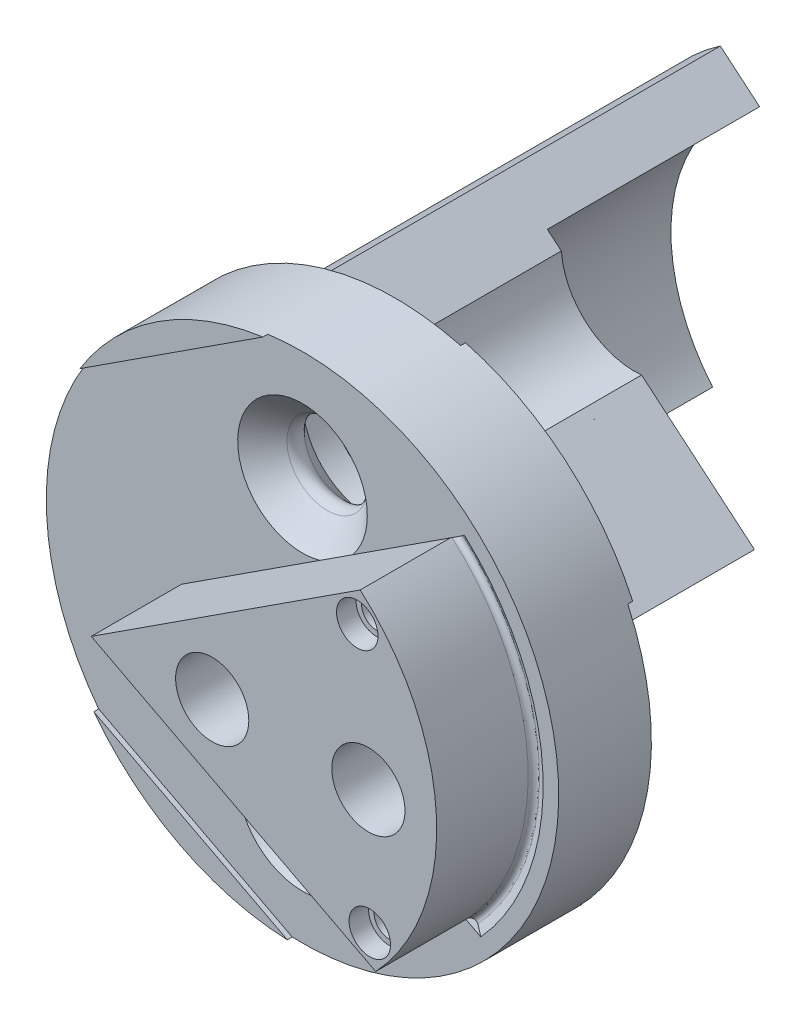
ISO-10303-21;
HEADER;
FILE_DESCRIPTION(('STEP AP214'),'2;1');
FILE_NAME('part.step','',(''),(''),'','','');
FILE_SCHEMA(('AUTOMOTIVE_DESIGN { 1 0 10303 214 1 1 1 1 }'));
ENDSEC;
DATA;
#1=APPLICATION_CONTEXT('core data for automotive mechanical design processes');
#2=APPLICATION_PROTOCOL_DEFINITION('international standard','automotive_design',2000,#1);
#3=PRODUCT_CONTEXT('',#1,'mechanical');
#4=PRODUCT('Part','Part','',(#3));
#5=PRODUCT_RELATED_PRODUCT_CATEGORY('part','',(#4));
#6=PRODUCT_DEFINITION_FORMATION('','',#4);
#7=PRODUCT_DEFINITION_CONTEXT('part definition',#1,'design');
#8=PRODUCT_DEFINITION('design','',#6,#7);
#9=PRODUCT_DEFINITION_SHAPE('','',#8);
#10=(LENGTH_UNIT() NAMED_UNIT(*) SI_UNIT(.MILLI.,.METRE.));
#11=(NAMED_UNIT(*) PLANE_ANGLE_UNIT() SI_UNIT($,.RADIAN.));
#12=(NAMED_UNIT(*) SI_UNIT($,.STERADIAN.) SOLID_ANGLE_UNIT());
#13=UNCERTAINTY_MEASURE_WITH_UNIT(LENGTH_MEASURE(1.E-05),#10,'distance_accuracy_value','');
#14=(GEOMETRIC_REPRESENTATION_CONTEXT(3) GLOBAL_UNCERTAINTY_ASSIGNED_CONTEXT((#13)) GLOBAL_UNIT_ASSIGNED_CONTEXT((#10,
#11,#12)) REPRESENTATION_CONTEXT('',''));
#15=CARTESIAN_POINT('',(0.,0.,0.));
#16=DIRECTION('',(0.,0.,1.));
#17=DIRECTION('',(1.,0.,0.));
#18=AXIS2_PLACEMENT_3D('',#15,#16,#17);
#19=CARTESIAN_POINT('',(0.,0.,-3.8));
#20=DIRECTION('',(0.,0.,1.));
#21=DIRECTION('',(1.,0.,0.));
#22=AXIS2_PLACEMENT_3D('',#19,#20,#21);
#23=PLANE('',#22);
#24=DIRECTION('',(-0.766044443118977,0.642787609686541,0.));
#25=VECTOR('',#24,1.);
#26=CARTESIAN_POINT('',(2.68062739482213,10.1520557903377,-3.8));
#27=LINE('',#26,#25);
#28=CARTESIAN_POINT('',(9.53233718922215,4.40278862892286,-3.8));
#29=VERTEX_POINT('',#28);
#30=CARTESIAN_POINT('',(2.68062739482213,10.1520557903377,-3.8));
#31=VERTEX_POINT('',#30);
#32=EDGE_CURVE('E473',#29,#31,#27,.T.);
#33=ORIENTED_EDGE('',*,*,#32,.F.);
#34=CARTESIAN_POINT('',(0.,0.,-3.8));
#35=DIRECTION('',(0.,0.,1.));
#36=DIRECTION('',(1.,0.,0.));
#37=AXIS2_PLACEMENT_3D('',#34,#35,#36);
#38=CIRCLE('',#37,10.5);
#39=CARTESIAN_POINT('',(7.4516245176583,-7.3975193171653,-3.8));
#40=VERTEX_POINT('',#39);
#41=EDGE_CURVE('E407',#40,#29,#38,.T.);
#42=ORIENTED_EDGE('',*,*,#41,.F.);
#43=DIRECTION('',(0.939692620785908,0.34202014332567,0.));
#44=VECTOR('',#43,1.);
#45=CARTESIAN_POINT('',(7.45162451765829,-7.39751931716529,-3.8));
#46=LINE('',#45,#44);
#47=CARTESIAN_POINT('',(-0.953241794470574,-10.456640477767,-3.8));
#48=VERTEX_POINT('',#47);
#49=EDGE_CURVE('E462',#48,#40,#46,.T.);
#50=ORIENTED_EDGE('',*,*,#49,.F.);
#51=EDGE_CURVE('E410',#31,#48,#38,.T.);
#52=ORIENTED_EDGE('',*,*,#51,.F.);
#53=EDGE_LOOP('',(#33,#42,#50,#52));
#54=FACE_BOUND('',#53,.T.);
#55=CARTESIAN_POINT('',(0.,6.,-3.8));
#56=DIRECTION('',(0.,0.,1.));
#57=DIRECTION('',(1.,0.,0.));
#58=AXIS2_PLACEMENT_3D('',#55,#56,#57);
#59=CIRCLE('',#58,2.75);
#60=CARTESIAN_POINT('',(2.75,6.,-3.8));
#61=VERTEX_POINT('',#60);
#62=EDGE_CURVE('E493',#61,#61,#59,.T.);
#63=ORIENTED_EDGE('',*,*,#62,.T.);
#64=EDGE_LOOP('',(#63));
#65=FACE_BOUND('',#64,.T.);
#66=CARTESIAN_POINT('',(0.,-6.,-3.8));
#67=DIRECTION('',(0.,0.,-1.));
#68=DIRECTION('',(1.,0.,0.));
#69=AXIS2_PLACEMENT_3D('',#66,#67,#68);
#70=CIRCLE('',#69,2.75);
#71=CARTESIAN_POINT('',(2.75,-6.,-3.8));
#72=VERTEX_POINT('',#71);
#73=EDGE_CURVE('E508',#72,#72,#70,.T.);
#74=ORIENTED_EDGE('',*,*,#73,.F.);
#75=EDGE_LOOP('',(#74));
#76=FACE_BOUND('',#75,.T.);
#77=CARTESIAN_POINT('',(6.4,0.,-3.8));
#78=DIRECTION('',(0.,0.,1.));
#79=DIRECTION('',(1.,0.,0.));
#80=AXIS2_PLACEMENT_3D('',#77,#78,#79);
#81=CIRCLE('',#80,1.5);
#82=CARTESIAN_POINT('',(7.9,0.,-3.8));
#83=VERTEX_POINT('',#82);
#84=EDGE_CURVE('E515',#83,#83,#81,.F.);
#85=ORIENTED_EDGE('',*,*,#84,.F.);
#86=EDGE_LOOP('',(#85));
#87=FACE_BOUND('',#86,.T.);
#88=CARTESIAN_POINT('',(6.45813692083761,-5.0529662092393,-3.8));
#89=DIRECTION('',(0.,0.,1.));
#90=DIRECTION('',(1.,0.,0.));
#91=AXIS2_PLACEMENT_3D('',#88,#89,#90);
#92=CIRCLE('',#91,0.624999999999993);
#93=CARTESIAN_POINT('',(7.0831369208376,-5.0529662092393,-3.8));
#94=VERTEX_POINT('',#93);
#95=EDGE_CURVE('E535',#94,#94,#92,.T.);
#96=ORIENTED_EDGE('',*,*,#95,.T.);
#97=EDGE_LOOP('',(#96));
#98=FACE_BOUND('',#97,.T.);
#99=CARTESIAN_POINT('',(5.94409959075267,5.64868834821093,-3.8));
#100=DIRECTION('',(0.,0.,1.));
#101=DIRECTION('',(1.,0.,0.));
#102=AXIS2_PLACEMENT_3D('',#99,#100,#101);
#103=CIRCLE('',#102,0.624999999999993);
#104=CARTESIAN_POINT('',(6.56909959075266,5.64868834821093,-3.8));
#105=VERTEX_POINT('',#104);
#106=EDGE_CURVE('E541',#105,#105,#103,.T.);
#107=ORIENTED_EDGE('',*,*,#106,.T.);
#108=EDGE_LOOP('',(#107));
#109=FACE_BOUND('',#108,.T.);
#110=DIRECTION('',(-0.939692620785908,-0.342020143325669,0.));
#111=VECTOR('',#110,1.);
#112=CARTESIAN_POINT('',(-7.76399835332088,-5.4863087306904,-3.8));
#113=LINE('',#112,#111);
#114=CARTESIAN_POINT('',(-7.46481213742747,-5.37741385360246,-3.8));
#115=VERTEX_POINT('',#114);
#116=CARTESIAN_POINT('',(-8.11000747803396,-5.61224575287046,-3.8));
#117=VERTEX_POINT('',#116);
#118=EDGE_CURVE('E318',#115,#117,#113,.T.);
#119=ORIENTED_EDGE('',*,*,#118,.F.);
#120=DIRECTION('',(-0.939692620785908,-0.342020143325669,0.));
#121=VECTOR('',#120,1.);
#122=CARTESIAN_POINT('',(4.92403876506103,-0.868240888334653,-3.8));
#123=LINE('',#122,#121);
#124=CARTESIAN_POINT('',(4.92403876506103,-0.868240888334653,-3.8));
#125=VERTEX_POINT('',#124);
#126=EDGE_CURVE('E327',#125,#115,#123,.T.);
#127=ORIENTED_EDGE('',*,*,#126,.F.);
#128=DIRECTION('',(0.766044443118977,-0.642787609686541,0.));
#129=VECTOR('',#128,1.);
#130=CARTESIAN_POINT('',(4.92403876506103,-0.868240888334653,-3.8));
#131=LINE('',#130,#129);
#132=CARTESIAN_POINT('',(0.296539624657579,3.01469193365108,-3.8));
#133=VERTEX_POINT('',#132);
#134=EDGE_CURVE('E339',#133,#125,#131,.T.);
#135=ORIENTED_EDGE('',*,*,#134,.F.);
#136=CARTESIAN_POINT('',(0.,6.,-3.8));
#137=DIRECTION('',(0.,0.,1.));
#138=DIRECTION('',(-1.,0.,0.));
#139=AXIS2_PLACEMENT_3D('',#136,#137,#138);
#140=CIRCLE('',#139,3.);
#141=CARTESIAN_POINT('',(-2.99144809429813,5.77364121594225,-3.8));
#142=VERTEX_POINT('',#141);
#143=EDGE_CURVE('E438',#142,#133,#140,.T.);
#144=ORIENTED_EDGE('',*,*,#143,.F.);
#145=DIRECTION('',(0.766044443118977,-0.642787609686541,0.));
#146=VECTOR('',#145,1.);
#147=CARTESIAN_POINT('',(-2.99144809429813,5.77364121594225,-3.8));
#148=LINE('',#147,#146);
#149=CARTESIAN_POINT('',(-5.17544502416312,7.60623223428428,-3.8));
#150=VERTEX_POINT('',#149);
#151=EDGE_CURVE('E435',#150,#142,#148,.T.);
#152=ORIENTED_EDGE('',*,*,#151,.F.);
#153=DIRECTION('',(-0.766044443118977,0.642787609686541,0.));
#154=VECTOR('',#153,1.);
#155=CARTESIAN_POINT('',(-5.7014130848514,8.04757184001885,-3.8));
#156=LINE('',#155,#154);
#157=CARTESIAN_POINT('',(-5.7014130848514,8.04757184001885,-3.8));
#158=VERTEX_POINT('',#157);
#159=EDGE_CURVE('E241',#150,#158,#156,.T.);
#160=ORIENTED_EDGE('',*,*,#159,.T.);
#161=CARTESIAN_POINT('',(0.,0.,-3.8));
#162=DIRECTION('',(0.,0.,-1.));
#163=DIRECTION('',(-1.,0.,0.));
#164=AXIS2_PLACEMENT_3D('',#161,#162,#163);
#165=CIRCLE('',#164,9.86253130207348);
#166=EDGE_CURVE('E294',#117,#158,#165,.T.);
#167=ORIENTED_EDGE('',*,*,#166,.F.);
#168=EDGE_LOOP('',(#119,#127,#135,#144,#152,#160,#167));
#169=FACE_BOUND('',#168,.T.);
#170=ADVANCED_FACE('F40',(#54,#65,#76,#87,#98,#109,#169),#23,.F.);
#171=CARTESIAN_POINT('',(6.45813692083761,-5.0529662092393,2.9));
#172=DIRECTION('',(0.,0.,-1.));
#173=DIRECTION('',(-1.,0.,0.));
#174=AXIS2_PLACEMENT_3D('',#171,#172,#173);
#175=PLANE('',#174);
#176=CARTESIAN_POINT('',(6.45813692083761,-5.0529662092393,2.9));
#177=DIRECTION('',(0.,0.,1.));
#178=DIRECTION('',(1.,0.,0.));
#179=AXIS2_PLACEMENT_3D('',#176,#177,#178);
#180=CIRCLE('',#179,0.85);
#181=CARTESIAN_POINT('',(7.30813692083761,-5.0529662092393,2.9));
#182=VERTEX_POINT('',#181);
#183=EDGE_CURVE('E523',#182,#182,#180,.T.);
#184=ORIENTED_EDGE('',*,*,#183,.T.);
#185=EDGE_LOOP('',(#184));
#186=FACE_BOUND('',#185,.T.);
#187=CARTESIAN_POINT('',(6.45813692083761,-5.0529662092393,2.9));
#188=DIRECTION('',(0.,0.,1.));
#189=DIRECTION('',(1.,0.,0.));
#190=AXIS2_PLACEMENT_3D('',#187,#188,#189);
#191=CIRCLE('',#190,0.624999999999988);
#192=CARTESIAN_POINT('',(7.0831369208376,-5.0529662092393,2.9));
#193=VERTEX_POINT('',#192);
#194=EDGE_CURVE('E538',#193,#193,#191,.T.);
#195=ORIENTED_EDGE('',*,*,#194,.F.);
#196=EDGE_LOOP('',(#195));
#197=FACE_BOUND('',#196,.T.);
#198=ADVANCED_FACE('F596',(#186,#197),#175,.F.);
#199=CARTESIAN_POINT('',(0.,6.,-22.3));
#200=DIRECTION('',(0.,0.,1.));
#201=DIRECTION('',(1.,0.,0.));
#202=AXIS2_PLACEMENT_3D('',#199,#200,#201);
#203=CYLINDRICAL_SURFACE('',#202,3.);
#204=CARTESIAN_POINT('',(0.,6.,-13.6));
#205=DIRECTION('',(0.,0.,-1.));
#206=DIRECTION('',(-1.,0.,0.));
#207=AXIS2_PLACEMENT_3D('',#204,#205,#206);
#208=CIRCLE('',#207,3.);
#209=CARTESIAN_POINT('',(-2.99144809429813,5.77364121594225,-13.6));
#210=VERTEX_POINT('',#209);
#211=CARTESIAN_POINT('',(0.296539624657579,3.01469193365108,-13.6));
#212=VERTEX_POINT('',#211);
#213=EDGE_CURVE('E448',#210,#212,#208,.F.);
#214=ORIENTED_EDGE('',*,*,#213,.F.);
#215=DIRECTION('',(0.,0.,1.));
#216=VECTOR('',#215,1.);
#217=CARTESIAN_POINT('',(-2.99144809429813,5.77364121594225,-22.3));
#218=LINE('',#217,#216);
#219=EDGE_CURVE('E351',#210,#142,#218,.T.);
#220=ORIENTED_EDGE('',*,*,#219,.T.);
#221=ORIENTED_EDGE('',*,*,#143,.T.);
#222=DIRECTION('',(0.,0.,1.));
#223=VECTOR('',#222,1.);
#224=CARTESIAN_POINT('',(0.296539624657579,3.01469193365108,-22.3));
#225=LINE('',#224,#223);
#226=EDGE_CURVE('E344',#212,#133,#225,.T.);
#227=ORIENTED_EDGE('',*,*,#226,.F.);
#228=EDGE_LOOP('',(#214,#220,#221,#227));
#229=FACE_BOUND('',#228,.T.);
#230=ADVANCED_FACE('F447',(#229),#203,.F.);
#231=CARTESIAN_POINT('',(4.92403876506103,-0.868240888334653,-22.3));
#232=DIRECTION('',(-0.642787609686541,-0.766044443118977,0.));
#233=DIRECTION('',(0.766044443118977,-0.642787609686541,0.));
#234=AXIS2_PLACEMENT_3D('',#231,#232,#233);
#235=PLANE('',#234);
#236=DIRECTION('',(0.766044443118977,-0.642787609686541,0.));
#237=VECTOR('',#236,1.);
#238=CARTESIAN_POINT('',(4.92403876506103,-0.868240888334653,-13.6));
#239=LINE('',#238,#237);
#240=CARTESIAN_POINT('',(4.92403876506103,-0.868240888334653,-13.6));
#241=VERTEX_POINT('',#240);
#242=EDGE_CURVE('E428',#212,#241,#239,.T.);
#243=ORIENTED_EDGE('',*,*,#242,.F.);
#244=ORIENTED_EDGE('',*,*,#226,.T.);
#245=ORIENTED_EDGE('',*,*,#134,.T.);
#246=DIRECTION('',(0.,0.,1.));
#247=VECTOR('',#246,1.);
#248=CARTESIAN_POINT('',(4.92403876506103,-0.868240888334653,-22.3));
#249=LINE('',#248,#247);
#250=EDGE_CURVE('E337',#241,#125,#249,.T.);
#251=ORIENTED_EDGE('',*,*,#250,.F.);
#252=EDGE_LOOP('',(#243,#244,#245,#251));
#253=FACE_BOUND('',#252,.T.);
#254=ADVANCED_FACE('F442',(#253),#235,.F.);
#255=CARTESIAN_POINT('',(0.,0.,0.));
#256=DIRECTION('',(0.,0.,1.));
#257=DIRECTION('',(1.,0.,0.));
#258=AXIS2_PLACEMENT_3D('',#255,#256,#257);
#259=PLANE('',#258);
#260=DIRECTION('',(0.887010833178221,-0.461748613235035,0.));
#261=VECTOR('',#260,1.);
#262=CARTESIAN_POINT('',(6.56061877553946,-6.23369683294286,0.));
#263=LINE('',#262,#261);
#264=CARTESIAN_POINT('',(6.69905628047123,-6.30576283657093,0.));
#265=VERTEX_POINT('',#264);
#266=CARTESIAN_POINT('',(7.30808017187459,-6.62280060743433,0.));
#267=VERTEX_POINT('',#266);
#268=EDGE_CURVE('E548',#265,#267,#263,.T.);
#269=ORIENTED_EDGE('',*,*,#268,.F.);
#270=DIRECTION('',(0.887010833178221,-0.461748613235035,0.));
#271=VECTOR('',#270,1.);
#272=CARTESIAN_POINT('',(-4.95682802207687,-0.238093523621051,0.));
#273=LINE('',#272,#271);
#274=CARTESIAN_POINT('',(-4.95682802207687,-0.238093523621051,0.));
#275=VERTEX_POINT('',#274);
#276=EDGE_CURVE('E389',#275,#265,#273,.T.);
#277=ORIENTED_EDGE('',*,*,#276,.F.);
#278=DIRECTION('',(0.838670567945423,0.544639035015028,0.));
#279=VECTOR('',#278,1.);
#280=CARTESIAN_POINT('',(-4.95682802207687,-0.238093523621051,0.));
#281=LINE('',#280,#279);
#282=CARTESIAN_POINT('',(0.70772619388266,3.44051099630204,0.));
#283=VERTEX_POINT('',#282);
#284=EDGE_CURVE('E384',#275,#283,#281,.T.);
#285=ORIENTED_EDGE('',*,*,#284,.T.);
#286=CARTESIAN_POINT('',(0.,6.,0.));
#287=DIRECTION('',(0.,0.,1.));
#288=DIRECTION('',(1.,0.,0.));
#289=AXIS2_PLACEMENT_3D('',#286,#287,#288);
#290=CIRCLE('',#289,2.65553390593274);
#291=CARTESIAN_POINT('',(2.05035137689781,4.31242198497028,0.));
#292=VERTEX_POINT('',#291);
#293=EDGE_CURVE('E483',#292,#283,#290,.T.);
#294=ORIENTED_EDGE('',*,*,#293,.F.);
#295=CARTESIAN_POINT('',(6.06383456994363,6.91880844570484,0.));
#296=VERTEX_POINT('',#295);
#297=EDGE_CURVE('E388',#292,#296,#281,.T.);
#298=ORIENTED_EDGE('',*,*,#297,.T.);
#299=DIRECTION('',(0.838670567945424,0.544639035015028,0.));
#300=VECTOR('',#299,1.);
#301=CARTESIAN_POINT('',(6.06383456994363,6.91880844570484,0.));
#302=LINE('',#301,#300);
#303=CARTESIAN_POINT('',(6.63966791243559,7.29275899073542,0.));
#304=VERTEX_POINT('',#303);
#305=EDGE_CURVE('E322',#296,#304,#302,.T.);
#306=ORIENTED_EDGE('',*,*,#305,.T.);
#307=CARTESIAN_POINT('',(0.,0.,0.));
#308=DIRECTION('',(0.,0.,1.));
#309=DIRECTION('',(1.,0.,0.));
#310=AXIS2_PLACEMENT_3D('',#307,#308,#309);
#311=CIRCLE('',#310,9.86253130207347);
#312=EDGE_CURVE('E555',#267,#304,#311,.T.);
#313=ORIENTED_EDGE('',*,*,#312,.F.);
#314=EDGE_LOOP('',(#269,#277,#285,#294,#298,#306,#313));
#315=FACE_BOUND('',#314,.T.);
#316=CARTESIAN_POINT('',(0.,-6.,0.));
#317=DIRECTION('',(0.,0.,-1.));
#318=DIRECTION('',(1.,0.,0.));
#319=AXIS2_PLACEMENT_3D('',#316,#317,#318);
#320=CIRCLE('',#319,2.65553390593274);
#321=CARTESIAN_POINT('',(2.65553390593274,-6.,0.));
#322=VERTEX_POINT('',#321);
#323=EDGE_CURVE('E496',#322,#322,#320,.T.);
#324=ORIENTED_EDGE('',*,*,#323,.T.);
#325=EDGE_LOOP('',(#324));
#326=FACE_BOUND('',#325,.T.);
#327=CARTESIAN_POINT('',(0.,0.,0.));
#328=DIRECTION('',(0.,0.,1.));
#329=DIRECTION('',(1.,0.,0.));
#330=AXIS2_PLACEMENT_3D('',#327,#328,#329);
#331=CIRCLE('',#330,10.5);
#332=CARTESIAN_POINT('',(-0.419778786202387,-10.4916054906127,0.));
#333=VERTEX_POINT('',#332);
#334=CARTESIAN_POINT('',(-1.42342203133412,10.4030702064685,0.));
#335=VERTEX_POINT('',#334);
#336=EDGE_CURVE('E411',#333,#335,#331,.T.);
#337=ORIENTED_EDGE('',*,*,#336,.T.);
#338=DIRECTION('',(0.838670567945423,0.544639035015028,0.));
#339=VECTOR('',#338,1.);
#340=CARTESIAN_POINT('',(-8.92471963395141,5.53167058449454,0.));
#341=LINE('',#340,#339);
#342=CARTESIAN_POINT('',(-8.92471963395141,5.53167058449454,0.));
#343=VERTEX_POINT('',#342);
#344=EDGE_CURVE('E356',#343,#335,#341,.T.);
#345=ORIENTED_EDGE('',*,*,#344,.F.);
#346=CARTESIAN_POINT('',(-8.35344486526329,-6.36160033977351,0.));
#347=VERTEX_POINT('',#346);
#348=EDGE_CURVE('E392',#343,#347,#331,.T.);
#349=ORIENTED_EDGE('',*,*,#348,.T.);
#350=DIRECTION('',(-0.887010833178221,0.461748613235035,0.));
#351=VECTOR('',#350,1.);
#352=CARTESIAN_POINT('',(-8.35344486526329,-6.36160033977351,0.));
#353=LINE('',#352,#351);
#354=EDGE_CURVE('E370',#333,#347,#353,.T.);
#355=ORIENTED_EDGE('',*,*,#354,.F.);
#356=EDGE_LOOP('',(#337,#345,#349,#355));
#357=FACE_BOUND('',#356,.T.);
#358=ADVANCED_FACE('F609',(#315,#326,#357),#259,.T.);
#359=CARTESIAN_POINT('',(0.,0.,-3.8));
#360=DIRECTION('',(0.,0.,1.));
#361=DIRECTION('',(1.,0.,0.));
#362=AXIS2_PLACEMENT_3D('',#359,#360,#361);
#363=CYLINDRICAL_SURFACE('',#362,10.5);
#364=ORIENTED_EDGE('',*,*,#41,.T.);
#365=DIRECTION('',(0.,0.,1.));
#366=VECTOR('',#365,1.);
#367=CARTESIAN_POINT('',(9.53233718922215,4.40278862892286,-4.));
#368=LINE('',#367,#366);
#369=CARTESIAN_POINT('',(9.53233718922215,4.40278862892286,-4.));
#370=VERTEX_POINT('',#369);
#371=EDGE_CURVE('E466',#370,#29,#368,.T.);
#372=ORIENTED_EDGE('',*,*,#371,.F.);
#373=CARTESIAN_POINT('',(0.,0.,-4.));
#374=DIRECTION('',(0.,0.,-1.));
#375=DIRECTION('',(-1.,0.,0.));
#376=AXIS2_PLACEMENT_3D('',#373,#374,#375);
#377=CIRCLE('',#376,10.5);
#378=CARTESIAN_POINT('',(2.68062739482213,10.1520557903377,-4.));
#379=VERTEX_POINT('',#378);
#380=EDGE_CURVE('E475',#379,#370,#377,.T.);
#381=ORIENTED_EDGE('',*,*,#380,.F.);
#382=DIRECTION('',(0.,0.,1.));
#383=VECTOR('',#382,1.);
#384=CARTESIAN_POINT('',(2.68062739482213,10.1520557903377,-4.));
#385=LINE('',#384,#383);
#386=EDGE_CURVE('E62',#379,#31,#385,.T.);
#387=ORIENTED_EDGE('',*,*,#386,.T.);
#388=ORIENTED_EDGE('',*,*,#51,.T.);
#389=DIRECTION('',(0.,0.,1.));
#390=VECTOR('',#389,1.);
#391=CARTESIAN_POINT('',(-0.953241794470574,-10.456640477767,-4.));
#392=LINE('',#391,#390);
#393=CARTESIAN_POINT('',(-0.953241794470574,-10.456640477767,-4.));
#394=VERTEX_POINT('',#393);
#395=EDGE_CURVE('E456',#394,#48,#392,.T.);
#396=ORIENTED_EDGE('',*,*,#395,.F.);
#397=CARTESIAN_POINT('',(0.,0.,-4.));
#398=DIRECTION('',(0.,0.,-1.));
#399=DIRECTION('',(1.,0.,0.));
#400=AXIS2_PLACEMENT_3D('',#397,#398,#399);
#401=CIRCLE('',#400,10.5);
#402=CARTESIAN_POINT('',(7.45162451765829,-7.39751931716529,-4.));
#403=VERTEX_POINT('',#402);
#404=EDGE_CURVE('E465',#403,#394,#401,.T.);
#405=ORIENTED_EDGE('',*,*,#404,.F.);
#406=DIRECTION('',(0.,0.,1.));
#407=VECTOR('',#406,1.);
#408=CARTESIAN_POINT('',(7.45162451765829,-7.39751931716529,-4.));
#409=LINE('',#408,#407);
#410=EDGE_CURVE('E459',#403,#40,#409,.T.);
#411=ORIENTED_EDGE('',*,*,#410,.T.);
#412=EDGE_LOOP('',(#364,#372,#381,#387,#388,#396,#405,#411));
#413=FACE_BOUND('',#412,.T.);
#414=ORIENTED_EDGE('',*,*,#336,.F.);
#415=DIRECTION('',(0.,0.,-1.));
#416=VECTOR('',#415,1.);
#417=CARTESIAN_POINT('',(-0.419778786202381,-10.4916054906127,0.2));
#418=LINE('',#417,#416);
#419=CARTESIAN_POINT('',(-0.419778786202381,-10.4916054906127,0.2));
#420=VERTEX_POINT('',#419);
#421=EDGE_CURVE('E381',#420,#333,#418,.T.);
#422=ORIENTED_EDGE('',*,*,#421,.F.);
#423=CARTESIAN_POINT('',(0.,0.,0.2));
#424=DIRECTION('',(0.,0.,1.));
#425=DIRECTION('',(1.,0.,0.));
#426=AXIS2_PLACEMENT_3D('',#423,#424,#425);
#427=CIRCLE('',#426,10.5);
#428=CARTESIAN_POINT('',(-8.35344486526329,-6.36160033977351,0.2));
#429=VERTEX_POINT('',#428);
#430=EDGE_CURVE('E371',#429,#420,#427,.T.);
#431=ORIENTED_EDGE('',*,*,#430,.F.);
#432=DIRECTION('',(0.,0.,-1.));
#433=VECTOR('',#432,1.);
#434=CARTESIAN_POINT('',(-8.35344486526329,-6.36160033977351,0.2));
#435=LINE('',#434,#433);
#436=EDGE_CURVE('E376',#429,#347,#435,.T.);
#437=ORIENTED_EDGE('',*,*,#436,.T.);
#438=ORIENTED_EDGE('',*,*,#348,.F.);
#439=DIRECTION('',(0.,0.,-1.));
#440=VECTOR('',#439,1.);
#441=CARTESIAN_POINT('',(-8.92471963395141,5.53167058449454,0.2));
#442=LINE('',#441,#440);
#443=CARTESIAN_POINT('',(-8.92471963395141,5.53167058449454,0.2));
#444=VERTEX_POINT('',#443);
#445=EDGE_CURVE('E367',#444,#343,#442,.T.);
#446=ORIENTED_EDGE('',*,*,#445,.F.);
#447=CARTESIAN_POINT('',(0.,0.,0.2));
#448=DIRECTION('',(0.,0.,1.));
#449=DIRECTION('',(1.,0.,0.));
#450=AXIS2_PLACEMENT_3D('',#447,#448,#449);
#451=CIRCLE('',#450,10.5);
#452=CARTESIAN_POINT('',(-1.42342203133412,10.4030702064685,0.2));
#453=VERTEX_POINT('',#452);
#454=EDGE_CURVE('E357',#453,#444,#451,.T.);
#455=ORIENTED_EDGE('',*,*,#454,.F.);
#456=DIRECTION('',(0.,0.,-1.));
#457=VECTOR('',#456,1.);
#458=CARTESIAN_POINT('',(-1.42342203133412,10.4030702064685,0.2));
#459=LINE('',#458,#457);
#460=EDGE_CURVE('E362',#453,#335,#459,.T.);
#461=ORIENTED_EDGE('',*,*,#460,.T.);
#462=EDGE_LOOP('',(#414,#422,#431,#437,#438,#446,#455,#461));
#463=FACE_BOUND('',#462,.T.);
#464=ADVANCED_FACE('F42',(#413,#463),#363,.T.);
#465=CARTESIAN_POINT('',(0.,0.,3.7));
#466=DIRECTION('',(0.,0.,1.));
#467=DIRECTION('',(1.,0.,0.));
#468=AXIS2_PLACEMENT_3D('',#465,#466,#467);
#469=PLANE('',#468);
#470=CARTESIAN_POINT('',(5.94409959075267,5.64868834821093,3.7));
#471=DIRECTION('',(0.,0.,1.));
#472=DIRECTION('',(1.,0.,0.));
#473=AXIS2_PLACEMENT_3D('',#470,#471,#472);
#474=CIRCLE('',#473,0.84999999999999);
#475=CARTESIAN_POINT('',(6.79409959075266,5.64868834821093,3.7));
#476=VERTEX_POINT('',#475);
#477=EDGE_CURVE('E532',#476,#476,#474,.T.);
#478=ORIENTED_EDGE('',*,*,#477,.F.);
#479=EDGE_LOOP('',(#478));
#480=FACE_BOUND('',#479,.T.);
#481=CARTESIAN_POINT('',(6.45813692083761,-5.0529662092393,3.7));
#482=DIRECTION('',(0.,0.,1.));
#483=DIRECTION('',(1.,0.,0.));
#484=AXIS2_PLACEMENT_3D('',#481,#482,#483);
#485=CIRCLE('',#484,0.84999999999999);
#486=CARTESIAN_POINT('',(7.3081369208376,-5.0529662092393,3.7));
#487=VERTEX_POINT('',#486);
#488=EDGE_CURVE('E526',#487,#487,#485,.T.);
#489=ORIENTED_EDGE('',*,*,#488,.F.);
#490=EDGE_LOOP('',(#489));
#491=FACE_BOUND('',#490,.T.);
#492=CARTESIAN_POINT('',(6.4,0.,3.7));
#493=DIRECTION('',(0.,0.,1.));
#494=DIRECTION('',(1.,0.,0.));
#495=AXIS2_PLACEMENT_3D('',#492,#493,#494);
#496=CIRCLE('',#495,1.5);
#497=CARTESIAN_POINT('',(7.9,0.,3.7));
#498=VERTEX_POINT('',#497);
#499=EDGE_CURVE('E520',#498,#498,#496,.T.);
#500=ORIENTED_EDGE('',*,*,#499,.F.);
#501=EDGE_LOOP('',(#500));
#502=FACE_BOUND('',#501,.T.);
#503=CARTESIAN_POINT('',(0.,0.,3.7));
#504=DIRECTION('',(0.,0.,1.));
#505=DIRECTION('',(1.,0.,0.));
#506=AXIS2_PLACEMENT_3D('',#503,#504,#505);
#507=CIRCLE('',#506,1.5);
#508=CARTESIAN_POINT('',(1.5,0.,3.7));
#509=VERTEX_POINT('',#508);
#510=EDGE_CURVE('E511',#509,#509,#507,.T.);
#511=ORIENTED_EDGE('',*,*,#510,.F.);
#512=EDGE_LOOP('',(#511));
#513=FACE_BOUND('',#512,.T.);
#514=DIRECTION('',(0.838670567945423,0.544639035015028,0.));
#515=VECTOR('',#514,1.);
#516=CARTESIAN_POINT('',(-4.95682802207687,-0.238093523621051,3.7));
#517=LINE('',#516,#515);
#518=CARTESIAN_POINT('',(-4.95682802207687,-0.23809352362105,3.7));
#519=VERTEX_POINT('',#518);
#520=CARTESIAN_POINT('',(6.06383456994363,6.91880844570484,3.7));
#521=VERTEX_POINT('',#520);
#522=EDGE_CURVE('E387',#519,#521,#517,.T.);
#523=ORIENTED_EDGE('',*,*,#522,.F.);
#524=DIRECTION('',(0.887010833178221,-0.461748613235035,0.));
#525=VECTOR('',#524,1.);
#526=CARTESIAN_POINT('',(-4.95682802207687,-0.238093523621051,3.7));
#527=LINE('',#526,#525);
#528=CARTESIAN_POINT('',(6.69905628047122,-6.30576283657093,3.7));
#529=VERTEX_POINT('',#528);
#530=EDGE_CURVE('E383',#519,#529,#527,.T.);
#531=ORIENTED_EDGE('',*,*,#530,.T.);
#532=CARTESIAN_POINT('',(0.,0.,3.7));
#533=DIRECTION('',(0.,0.,1.));
#534=DIRECTION('',(1.,0.,0.));
#535=AXIS2_PLACEMENT_3D('',#532,#533,#534);
#536=CIRCLE('',#535,9.2);
#537=EDGE_CURVE('E398',#529,#521,#536,.T.);
#538=ORIENTED_EDGE('',*,*,#537,.T.);
#539=EDGE_LOOP('',(#523,#531,#538));
#540=FACE_BOUND('',#539,.T.);
#541=ADVANCED_FACE('F607',(#480,#491,#502,#513,#540),#469,.T.);
#542=CARTESIAN_POINT('',(-4.95682802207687,-0.238093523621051,30.5727918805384));
#543=DIRECTION('',(-0.544639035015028,0.838670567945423,0.));
#544=DIRECTION('',(-0.838670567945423,-0.544639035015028,0.));
#545=AXIS2_PLACEMENT_3D('',#542,#543,#544);
#546=PLANE('',#545);
#547=DIRECTION('',(0.,0.,-1.));
#548=VECTOR('',#547,1.);
#549=CARTESIAN_POINT('',(-4.95682802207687,-0.238093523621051,30.5727918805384));
#550=LINE('',#549,#548);
#551=EDGE_CURVE('E393',#519,#275,#550,.T.);
#552=ORIENTED_EDGE('',*,*,#551,.F.);
#553=ORIENTED_EDGE('',*,*,#522,.T.);
#554=DIRECTION('',(0.,0.,-1.));
#555=VECTOR('',#554,1.);
#556=CARTESIAN_POINT('',(6.06383456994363,6.91880844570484,30.5727918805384));
#557=LINE('',#556,#555);
#558=EDGE_CURVE('E396',#521,#296,#557,.T.);
#559=ORIENTED_EDGE('',*,*,#558,.T.);
#560=ORIENTED_EDGE('',*,*,#297,.F.);
#561=DIRECTION('',(-0.838670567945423,-0.544639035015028,0.));
#562=VECTOR('',#561,1.);
#563=CARTESIAN_POINT('',(-4.95682802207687,-0.238093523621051,0.));
#564=LINE('',#563,#562);
#565=EDGE_CURVE('E476',#292,#283,#564,.T.);
#566=ORIENTED_EDGE('',*,*,#565,.T.);
#567=ORIENTED_EDGE('',*,*,#284,.F.);
#568=EDGE_LOOP('',(#552,#553,#559,#560,#566,#567));
#569=FACE_BOUND('',#568,.T.);
#570=ADVANCED_FACE('F659',(#569),#546,.T.);
#571=CARTESIAN_POINT('',(0.,0.,30.5727918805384));
#572=DIRECTION('',(0.,0.,-1.));
#573=DIRECTION('',(-1.,0.,0.));
#574=AXIS2_PLACEMENT_3D('',#571,#572,#573);
#575=CYLINDRICAL_SURFACE('',#574,9.2);
#576=ORIENTED_EDGE('',*,*,#537,.F.);
#577=DIRECTION('',(0.,0.,-1.));
#578=VECTOR('',#577,1.);
#579=CARTESIAN_POINT('',(6.69905628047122,-6.30576283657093,30.5727918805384));
#580=LINE('',#579,#578);
#581=EDGE_CURVE('E400',#529,#265,#580,.T.);
#582=ORIENTED_EDGE('',*,*,#581,.T.);
#583=DIRECTION('',(0.,0.,1.));
#584=VECTOR('',#583,1.);
#585=CARTESIAN_POINT('',(6.69905628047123,-6.30576283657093,0.));
#586=LINE('',#585,#584);
#587=CARTESIAN_POINT('',(6.69905628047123,-6.30576283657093,-0.0500000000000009));
#588=VERTEX_POINT('',#587);
#589=EDGE_CURVE('E547',#588,#265,#586,.T.);
#590=ORIENTED_EDGE('',*,*,#589,.F.);
#591=CARTESIAN_POINT('',(0.,0.,-0.0500000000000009));
#592=DIRECTION('',(0.,0.,1.));
#593=DIRECTION('',(1.,0.,0.));
#594=AXIS2_PLACEMENT_3D('',#591,#592,#593);
#595=CIRCLE('',#594,9.2);
#596=CARTESIAN_POINT('',(6.06383456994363,6.91880844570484,-0.0500000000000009));
#597=VERTEX_POINT('',#596);
#598=EDGE_CURVE('E551',#588,#597,#595,.T.);
#599=ORIENTED_EDGE('',*,*,#598,.T.);
#600=DIRECTION('',(0.,0.,1.));
#601=VECTOR('',#600,1.);
#602=CARTESIAN_POINT('',(6.06383456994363,6.91880844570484,0.));
#603=LINE('',#602,#601);
#604=EDGE_CURVE('E320',#597,#296,#603,.T.);
#605=ORIENTED_EDGE('',*,*,#604,.T.);
#606=ORIENTED_EDGE('',*,*,#558,.F.);
#607=EDGE_LOOP('',(#576,#582,#590,#599,#605,#606));
#608=FACE_BOUND('',#607,.T.);
#609=ADVANCED_FACE('F656',(#608),#575,.T.);
#610=CARTESIAN_POINT('',(-4.95682802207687,-0.238093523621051,30.5727918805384));
#611=DIRECTION('',(0.461748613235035,0.887010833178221,0.));
#612=DIRECTION('',(-0.887010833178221,0.461748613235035,0.));
#613=AXIS2_PLACEMENT_3D('',#610,#611,#612);
#614=PLANE('',#613);
#615=ORIENTED_EDGE('',*,*,#530,.F.);
#616=ORIENTED_EDGE('',*,*,#551,.T.);
#617=ORIENTED_EDGE('',*,*,#276,.T.);
#618=ORIENTED_EDGE('',*,*,#581,.F.);
#619=EDGE_LOOP('',(#615,#616,#617,#618));
#620=FACE_BOUND('',#619,.T.);
#621=ADVANCED_FACE('F652',(#620),#614,.F.);
#622=CARTESIAN_POINT('',(-8.35344486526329,-6.36160033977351,0.2));
#623=DIRECTION('',(-0.461748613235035,-0.887010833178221,0.));
#624=DIRECTION('',(0.887010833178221,-0.461748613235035,0.));
#625=AXIS2_PLACEMENT_3D('',#622,#623,#624);
#626=PLANE('',#625);
#627=ORIENTED_EDGE('',*,*,#354,.T.);
#628=ORIENTED_EDGE('',*,*,#436,.F.);
#629=DIRECTION('',(-0.887010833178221,0.461748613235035,0.));
#630=VECTOR('',#629,1.);
#631=CARTESIAN_POINT('',(-8.35344486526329,-6.36160033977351,0.2));
#632=LINE('',#631,#630);
#633=EDGE_CURVE('E374',#420,#429,#632,.T.);
#634=ORIENTED_EDGE('',*,*,#633,.F.);
#635=ORIENTED_EDGE('',*,*,#421,.T.);
#636=EDGE_LOOP('',(#627,#628,#634,#635));
#637=FACE_BOUND('',#636,.T.);
#638=ADVANCED_FACE('F648',(#637),#626,.F.);
#639=CARTESIAN_POINT('',(0.,0.,0.2));
#640=DIRECTION('',(0.,0.,1.));
#641=DIRECTION('',(1.,0.,0.));
#642=AXIS2_PLACEMENT_3D('',#639,#640,#641);
#643=PLANE('',#642);
#644=ORIENTED_EDGE('',*,*,#430,.T.);
#645=ORIENTED_EDGE('',*,*,#633,.T.);
#646=EDGE_LOOP('',(#644,#645));
#647=FACE_BOUND('',#646,.T.);
#648=ADVANCED_FACE('F642',(#647),#643,.T.);
#649=CARTESIAN_POINT('',(-8.92471963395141,5.53167058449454,0.2));
#650=DIRECTION('',(-0.544639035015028,0.838670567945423,0.));
#651=DIRECTION('',(-0.838670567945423,-0.544639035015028,0.));
#652=AXIS2_PLACEMENT_3D('',#649,#650,#651);
#653=PLANE('',#652);
#654=ORIENTED_EDGE('',*,*,#344,.T.);
#655=ORIENTED_EDGE('',*,*,#460,.F.);
#656=DIRECTION('',(0.838670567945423,0.544639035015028,0.));
#657=VECTOR('',#656,1.);
#658=CARTESIAN_POINT('',(-8.92471963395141,5.53167058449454,0.2));
#659=LINE('',#658,#657);
#660=EDGE_CURVE('E360',#444,#453,#659,.T.);
#661=ORIENTED_EDGE('',*,*,#660,.F.);
#662=ORIENTED_EDGE('',*,*,#445,.T.);
#663=EDGE_LOOP('',(#654,#655,#661,#662));
#664=FACE_BOUND('',#663,.T.);
#665=ADVANCED_FACE('F630',(#664),#653,.F.);
#666=CARTESIAN_POINT('',(0.,0.,0.2));
#667=DIRECTION('',(0.,0.,1.));
#668=DIRECTION('',(1.,0.,0.));
#669=AXIS2_PLACEMENT_3D('',#666,#667,#668);
#670=PLANE('',#669);
#671=ORIENTED_EDGE('',*,*,#454,.T.);
#672=ORIENTED_EDGE('',*,*,#660,.T.);
#673=EDGE_LOOP('',(#671,#672));
#674=FACE_BOUND('',#673,.T.);
#675=ADVANCED_FACE('F634',(#674),#670,.T.);
#676=CARTESIAN_POINT('',(0.,0.,-22.3));
#677=DIRECTION('',(0.,0.,1.));
#678=DIRECTION('',(1.,0.,0.));
#679=AXIS2_PLACEMENT_3D('',#676,#677,#678);
#680=CYLINDRICAL_SURFACE('',#679,9.2);
#681=DIRECTION('',(0.,0.,1.));
#682=VECTOR('',#681,1.);
#683=CARTESIAN_POINT('',(-7.46481213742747,-5.37741385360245,-22.3));
#684=LINE('',#683,#682);
#685=CARTESIAN_POINT('',(-7.46481213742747,-5.37741385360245,-22.3));
#686=VERTEX_POINT('',#685);
#687=EDGE_CURVE('E333',#686,#115,#684,.T.);
#688=ORIENTED_EDGE('',*,*,#687,.T.);
#689=DIRECTION('',(0.,0.,-1.));
#690=VECTOR('',#689,1.);
#691=CARTESIAN_POINT('',(-7.46481213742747,-5.37741385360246,-3.8));
#692=LINE('',#691,#690);
#693=CARTESIAN_POINT('',(-7.46481213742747,-5.37741385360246,-3.75));
#694=VERTEX_POINT('',#693);
#695=EDGE_CURVE('E250',#694,#115,#692,.T.);
#696=ORIENTED_EDGE('',*,*,#695,.F.);
#697=CARTESIAN_POINT('',(0.,0.,-3.75));
#698=DIRECTION('',(0.,0.,-1.));
#699=DIRECTION('',(-1.,0.,0.));
#700=AXIS2_PLACEMENT_3D('',#697,#698,#699);
#701=CIRCLE('',#700,9.2);
#702=CARTESIAN_POINT('',(-5.17544502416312,7.60623223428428,-3.75));
#703=VERTEX_POINT('',#702);
#704=EDGE_CURVE('E275',#694,#703,#701,.T.);
#705=ORIENTED_EDGE('',*,*,#704,.T.);
#706=DIRECTION('',(0.,0.,-1.));
#707=VECTOR('',#706,1.);
#708=CARTESIAN_POINT('',(-5.17544502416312,7.60623223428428,-3.8));
#709=LINE('',#708,#707);
#710=EDGE_CURVE('E290',#703,#150,#709,.T.);
#711=ORIENTED_EDGE('',*,*,#710,.T.);
#712=DIRECTION('',(0.,0.,1.));
#713=VECTOR('',#712,1.);
#714=CARTESIAN_POINT('',(-5.17544502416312,7.60623223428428,-22.3));
#715=LINE('',#714,#713);
#716=CARTESIAN_POINT('',(-5.17544502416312,7.60623223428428,-22.3));
#717=VERTEX_POINT('',#716);
#718=EDGE_CURVE('E353',#717,#150,#715,.T.);
#719=ORIENTED_EDGE('',*,*,#718,.F.);
#720=CARTESIAN_POINT('',(0.,0.,-22.3));
#721=DIRECTION('',(0.,0.,-1.));
#722=DIRECTION('',(-1.,0.,0.));
#723=AXIS2_PLACEMENT_3D('',#720,#721,#722);
#724=CIRCLE('',#723,9.2);
#725=EDGE_CURVE('E338',#686,#717,#724,.T.);
#726=ORIENTED_EDGE('',*,*,#725,.F.);
#727=EDGE_LOOP('',(#688,#696,#705,#711,#719,#726));
#728=FACE_BOUND('',#727,.T.);
#729=ADVANCED_FACE('F304',(#728),#680,.T.);
#730=CARTESIAN_POINT('',(-2.99144809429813,5.77364121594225,-22.3));
#731=DIRECTION('',(-0.642787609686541,-0.766044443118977,0.));
#732=DIRECTION('',(0.766044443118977,-0.642787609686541,0.));
#733=AXIS2_PLACEMENT_3D('',#730,#731,#732);
#734=PLANE('',#733);
#735=DIRECTION('',(0.766044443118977,-0.642787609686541,0.));
#736=VECTOR('',#735,1.);
#737=CARTESIAN_POINT('',(-2.99144809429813,5.77364121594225,-13.6));
#738=LINE('',#737,#736);
#739=CARTESIAN_POINT('',(-3.56539119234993,6.25523665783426,-13.6));
#740=VERTEX_POINT('',#739);
#741=EDGE_CURVE('E427',#740,#210,#738,.T.);
#742=ORIENTED_EDGE('',*,*,#741,.F.);
#743=DIRECTION('',(0.,0.,-1.));
#744=VECTOR('',#743,1.);
#745=CARTESIAN_POINT('',(-3.56539119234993,6.25523665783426,-13.6));
#746=LINE('',#745,#744);
#747=CARTESIAN_POINT('',(-3.56539119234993,6.25523665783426,-22.3));
#748=VERTEX_POINT('',#747);
#749=EDGE_CURVE('E417',#740,#748,#746,.T.);
#750=ORIENTED_EDGE('',*,*,#749,.T.);
#751=DIRECTION('',(0.766044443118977,-0.642787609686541,0.));
#752=VECTOR('',#751,1.);
#753=CARTESIAN_POINT('',(-2.99144809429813,5.77364121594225,-22.3));
#754=LINE('',#753,#752);
#755=EDGE_CURVE('E346',#717,#748,#754,.T.);
#756=ORIENTED_EDGE('',*,*,#755,.F.);
#757=ORIENTED_EDGE('',*,*,#718,.T.);
#758=ORIENTED_EDGE('',*,*,#151,.T.);
#759=ORIENTED_EDGE('',*,*,#219,.F.);
#760=EDGE_LOOP('',(#742,#750,#756,#757,#758,#759));
#761=FACE_BOUND('',#760,.T.);
#762=ADVANCED_FACE('F425',(#761),#734,.F.);
#763=CARTESIAN_POINT('',(4.92403876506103,-0.868240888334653,-22.3));
#764=DIRECTION('',(-0.342020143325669,0.939692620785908,0.));
#765=DIRECTION('',(-0.939692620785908,-0.342020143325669,0.));
#766=AXIS2_PLACEMENT_3D('',#763,#764,#765);
#767=PLANE('',#766);
#768=DIRECTION('',(-0.939692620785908,-0.342020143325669,0.));
#769=VECTOR('',#768,1.);
#770=CARTESIAN_POINT('',(4.92403876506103,-0.868240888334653,-22.3));
#771=LINE('',#770,#769);
#772=CARTESIAN_POINT('',(-5.48978873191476,-4.65856412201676,-22.3));
#773=VERTEX_POINT('',#772);
#774=EDGE_CURVE('E342',#773,#686,#771,.T.);
#775=ORIENTED_EDGE('',*,*,#774,.F.);
#776=DIRECTION('',(0.,0.,-1.));
#777=VECTOR('',#776,1.);
#778=CARTESIAN_POINT('',(-5.48978873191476,-4.65856412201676,-13.6));
#779=LINE('',#778,#777);
#780=CARTESIAN_POINT('',(-5.48978873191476,-4.65856412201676,-13.6));
#781=VERTEX_POINT('',#780);
#782=EDGE_CURVE('E420',#773,#781,#779,.F.);
#783=ORIENTED_EDGE('',*,*,#782,.T.);
#784=DIRECTION('',(-0.939692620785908,-0.342020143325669,0.));
#785=VECTOR('',#784,1.);
#786=CARTESIAN_POINT('',(4.92403876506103,-0.868240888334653,-13.6));
#787=LINE('',#786,#785);
#788=EDGE_CURVE('E12',#241,#781,#787,.T.);
#789=ORIENTED_EDGE('',*,*,#788,.F.);
#790=ORIENTED_EDGE('',*,*,#250,.T.);
#791=ORIENTED_EDGE('',*,*,#126,.T.);
#792=ORIENTED_EDGE('',*,*,#687,.F.);
#793=EDGE_LOOP('',(#775,#783,#789,#790,#791,#792));
#794=FACE_BOUND('',#793,.T.);
#795=ADVANCED_FACE('F332',(#794),#767,.F.);
#796=CARTESIAN_POINT('',(0.,0.,-22.3));
#797=DIRECTION('',(0.,0.,-1.));
#798=DIRECTION('',(-1.,0.,0.));
#799=AXIS2_PLACEMENT_3D('',#796,#797,#798);
#800=PLANE('',#799);
#801=CARTESIAN_POINT('',(-7.06243110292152,-4.16678136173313,-22.3));
#802=DIRECTION('',(0.,0.,-1.));
#803=DIRECTION('',(-1.,0.,0.));
#804=AXIS2_PLACEMENT_3D('',#801,#802,#803);
#805=CIRCLE('',#804,0.54999999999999);
#806=CARTESIAN_POINT('',(-7.61243110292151,-4.16678136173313,-22.3));
#807=VERTEX_POINT('',#806);
#808=EDGE_CURVE('E225',#807,#807,#805,.T.);
#809=ORIENTED_EDGE('',*,*,#808,.F.);
#810=EDGE_LOOP('',(#809));
#811=FACE_BOUND('',#810,.T.);
#812=CARTESIAN_POINT('',(-5.21139123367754,6.33098739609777,-22.3));
#813=DIRECTION('',(0.,0.,-1.));
#814=DIRECTION('',(-1.,0.,0.));
#815=AXIS2_PLACEMENT_3D('',#812,#813,#814);
#816=CIRCLE('',#815,0.54999999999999);
#817=CARTESIAN_POINT('',(-5.76139123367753,6.33098739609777,-22.3));
#818=VERTEX_POINT('',#817);
#819=EDGE_CURVE('E224',#818,#818,#816,.T.);
#820=ORIENTED_EDGE('',*,*,#819,.F.);
#821=EDGE_LOOP('',(#820));
#822=FACE_BOUND('',#821,.T.);
#823=CARTESIAN_POINT('',(-8.0754235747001,1.42391505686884,-22.3));
#824=DIRECTION('',(0.,0.,-1.));
#825=DIRECTION('',(-1.,0.,0.));
#826=AXIS2_PLACEMENT_3D('',#823,#824,#825);
#827=CIRCLE('',#826,0.54999999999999);
#828=CARTESIAN_POINT('',(-8.62542357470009,1.42391505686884,-22.3));
#829=VERTEX_POINT('',#828);
#830=EDGE_CURVE('E235',#829,#829,#827,.T.);
#831=ORIENTED_EDGE('',*,*,#830,.F.);
#832=EDGE_LOOP('',(#831));
#833=FACE_BOUND('',#832,.T.);
#834=CARTESIAN_POINT('',(0.,0.,-22.3));
#835=DIRECTION('',(0.,0.,-1.));
#836=DIRECTION('',(-1.,0.,0.));
#837=AXIS2_PLACEMENT_3D('',#834,#835,#836);
#838=CIRCLE('',#837,7.2);
#839=EDGE_CURVE('E48',#773,#748,#838,.T.);
#840=ORIENTED_EDGE('',*,*,#839,.F.);
#841=ORIENTED_EDGE('',*,*,#774,.T.);
#842=ORIENTED_EDGE('',*,*,#725,.T.);
#843=ORIENTED_EDGE('',*,*,#755,.T.);
#844=EDGE_LOOP('',(#840,#841,#842,#843));
#845=FACE_BOUND('',#844,.T.);
#846=ADVANCED_FACE('F430',(#811,#822,#833,#845),#800,.T.);
#847=CARTESIAN_POINT('',(0.,0.,-13.6));
#848=DIRECTION('',(0.,0.,-1.));
#849=DIRECTION('',(-1.,0.,0.));
#850=AXIS2_PLACEMENT_3D('',#847,#848,#849);
#851=PLANE('',#850);
#852=CARTESIAN_POINT('',(0.,0.,-13.6));
#853=DIRECTION('',(0.,0.,-1.));
#854=DIRECTION('',(-1.,0.,0.));
#855=AXIS2_PLACEMENT_3D('',#852,#853,#854);
#856=CIRCLE('',#855,1.5);
#857=CARTESIAN_POINT('',(-1.5,0.,-13.6));
#858=VERTEX_POINT('',#857);
#859=EDGE_CURVE('E512',#858,#858,#856,.F.);
#860=ORIENTED_EDGE('',*,*,#859,.T.);
#861=EDGE_LOOP('',(#860));
#862=FACE_BOUND('',#861,.T.);
#863=ORIENTED_EDGE('',*,*,#741,.T.);
#864=ORIENTED_EDGE('',*,*,#213,.T.);
#865=ORIENTED_EDGE('',*,*,#242,.T.);
#866=ORIENTED_EDGE('',*,*,#788,.T.);
#867=CARTESIAN_POINT('',(0.,0.,-13.6));
#868=DIRECTION('',(0.,0.,-1.));
#869=DIRECTION('',(-1.,0.,0.));
#870=AXIS2_PLACEMENT_3D('',#867,#868,#869);
#871=CIRCLE('',#870,7.2);
#872=EDGE_CURVE('E454',#781,#740,#871,.T.);
#873=ORIENTED_EDGE('',*,*,#872,.T.);
#874=EDGE_LOOP('',(#863,#864,#865,#866,#873));
#875=FACE_BOUND('',#874,.T.);
#876=ADVANCED_FACE('F725',(#862,#875),#851,.T.);
#877=CARTESIAN_POINT('',(0.,0.,-13.6));
#878=DIRECTION('',(0.,0.,-1.));
#879=DIRECTION('',(-1.,0.,0.));
#880=AXIS2_PLACEMENT_3D('',#877,#878,#879);
#881=CYLINDRICAL_SURFACE('',#880,7.2);
#882=ORIENTED_EDGE('',*,*,#872,.F.);
#883=ORIENTED_EDGE('',*,*,#782,.F.);
#884=ORIENTED_EDGE('',*,*,#839,.T.);
#885=ORIENTED_EDGE('',*,*,#749,.F.);
#886=EDGE_LOOP('',(#882,#883,#884,#885));
#887=FACE_BOUND('',#886,.T.);
#888=ADVANCED_FACE('F416',(#887),#881,.F.);
#889=CARTESIAN_POINT('',(7.45162451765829,-7.39751931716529,-4.));
#890=DIRECTION('',(0.34202014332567,-0.939692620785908,0.));
#891=DIRECTION('',(0.939692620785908,0.34202014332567,0.));
#892=AXIS2_PLACEMENT_3D('',#889,#890,#891);
#893=PLANE('',#892);
#894=ORIENTED_EDGE('',*,*,#49,.T.);
#895=ORIENTED_EDGE('',*,*,#410,.F.);
#896=DIRECTION('',(0.939692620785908,0.34202014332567,0.));
#897=VECTOR('',#896,1.);
#898=CARTESIAN_POINT('',(7.45162451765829,-7.39751931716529,-4.));
#899=LINE('',#898,#897);
#900=EDGE_CURVE('E461',#394,#403,#899,.T.);
#901=ORIENTED_EDGE('',*,*,#900,.F.);
#902=ORIENTED_EDGE('',*,*,#395,.T.);
#903=EDGE_LOOP('',(#894,#895,#901,#902));
#904=FACE_BOUND('',#903,.T.);
#905=ADVANCED_FACE('F720',(#904),#893,.F.);
#906=CARTESIAN_POINT('',(0.,0.,-4.));
#907=DIRECTION('',(0.,0.,1.));
#908=DIRECTION('',(1.,0.,0.));
#909=AXIS2_PLACEMENT_3D('',#906,#907,#908);
#910=PLANE('',#909);
#911=ORIENTED_EDGE('',*,*,#404,.T.);
#912=ORIENTED_EDGE('',*,*,#900,.T.);
#913=EDGE_LOOP('',(#911,#912));
#914=FACE_BOUND('',#913,.T.);
#915=ADVANCED_FACE('F716',(#914),#910,.F.);
#916=CARTESIAN_POINT('',(2.68062739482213,10.1520557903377,-4.));
#917=DIRECTION('',(0.642787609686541,0.766044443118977,0.));
#918=DIRECTION('',(-0.766044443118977,0.642787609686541,0.));
#919=AXIS2_PLACEMENT_3D('',#916,#917,#918);
#920=PLANE('',#919);
#921=ORIENTED_EDGE('',*,*,#32,.T.);
#922=ORIENTED_EDGE('',*,*,#386,.F.);
#923=DIRECTION('',(-0.766044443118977,0.642787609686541,0.));
#924=VECTOR('',#923,1.);
#925=CARTESIAN_POINT('',(2.68062739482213,10.1520557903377,-4.));
#926=LINE('',#925,#924);
#927=EDGE_CURVE('E472',#370,#379,#926,.T.);
#928=ORIENTED_EDGE('',*,*,#927,.F.);
#929=ORIENTED_EDGE('',*,*,#371,.T.);
#930=EDGE_LOOP('',(#921,#922,#928,#929));
#931=FACE_BOUND('',#930,.T.);
#932=ADVANCED_FACE('F712',(#931),#920,.F.);
#933=CARTESIAN_POINT('',(0.,0.,-4.));
#934=DIRECTION('',(0.,0.,-1.));
#935=DIRECTION('',(-1.,0.,0.));
#936=AXIS2_PLACEMENT_3D('',#933,#934,#935);
#937=PLANE('',#936);
#938=ORIENTED_EDGE('',*,*,#380,.T.);
#939=ORIENTED_EDGE('',*,*,#927,.T.);
#940=EDGE_LOOP('',(#938,#939));
#941=FACE_BOUND('',#940,.T.);
#942=ADVANCED_FACE('F704',(#941),#937,.T.);
#943=CARTESIAN_POINT('',(0.,6.,0.));
#944=DIRECTION('',(0.,0.,-1.));
#945=DIRECTION('',(-1.,0.,0.));
#946=AXIS2_PLACEMENT_3D('',#943,#944,#945);
#947=PLANE('',#946);
#948=EDGE_CURVE('E54',#283,#292,#290,.T.);
#949=ORIENTED_EDGE('',*,*,#948,.F.);
#950=ORIENTED_EDGE('',*,*,#565,.F.);
#951=EDGE_LOOP('',(#949,#950));
#952=FACE_BOUND('',#951,.T.);
#953=ADVANCED_FACE('F689',(#952),#947,.T.);
#954=CARTESIAN_POINT('',(0.,6.,-1.36264068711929));
#955=DIRECTION('',(0.,0.,1.));
#956=DIRECTION('',(1.,0.,0.));
#957=AXIS2_PLACEMENT_3D('',#954,#955,#956);
#958=TOROIDAL_SURFACE('',#957,2.,0.499999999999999);
#959=CARTESIAN_POINT('',(0.,6.,-1.72685518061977));
#960=DIRECTION('',(0.,0.,1.));
#961=DIRECTION('',(1.,0.,0.));
#962=AXIS2_PLACEMENT_3D('',#959,#960,#961);
#963=CIRCLE('',#962,1.65743934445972);
#964=CARTESIAN_POINT('',(1.65743934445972,6.,-1.72685518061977));
#965=VERTEX_POINT('',#964);
#966=EDGE_CURVE('E487',#965,#965,#963,.T.);
#967=ORIENTED_EDGE('',*,*,#966,.F.);
#968=EDGE_LOOP('',(#967));
#969=FACE_BOUND('',#968,.T.);
#970=CARTESIAN_POINT('',(0.,6.,-1.00908729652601));
#971=DIRECTION('',(0.,0.,1.));
#972=DIRECTION('',(1.,0.,0.));
#973=AXIS2_PLACEMENT_3D('',#970,#971,#972);
#974=CIRCLE('',#973,1.64644660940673);
#975=CARTESIAN_POINT('',(1.64644660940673,6.,-1.00908729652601));
#976=VERTEX_POINT('',#975);
#977=EDGE_CURVE('E484',#976,#976,#974,.T.);
#978=ORIENTED_EDGE('',*,*,#977,.T.);
#979=EDGE_LOOP('',(#978));
#980=FACE_BOUND('',#979,.T.);
#981=ADVANCED_FACE('F694',(#969,#980),#958,.T.);
#982=CARTESIAN_POINT('',(0.,6.,-1.00908729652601));
#983=DIRECTION('',(0.,0.,1.));
#984=DIRECTION('',(1.,0.,0.));
#985=AXIS2_PLACEMENT_3D('',#982,#983,#984);
#986=CONICAL_SURFACE('',#985,1.64644660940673,0.785398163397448);
#987=ORIENTED_EDGE('',*,*,#948,.T.);
#988=ORIENTED_EDGE('',*,*,#293,.T.);
#989=EDGE_LOOP('',(#987,#988));
#990=FACE_BOUND('',#989,.T.);
#991=ORIENTED_EDGE('',*,*,#977,.F.);
#992=EDGE_LOOP('',(#991));
#993=FACE_BOUND('',#992,.T.);
#994=ADVANCED_FACE('F690',(#990,#993),#986,.F.);
#995=CARTESIAN_POINT('',(0.,6.,-2.7544592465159));
#996=DIRECTION('',(0.,0.,-1.));
#997=DIRECTION('',(-1.,0.,0.));
#998=AXIS2_PLACEMENT_3D('',#995,#996,#997);
#999=CONICAL_SURFACE('',#998,2.75,0.816026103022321);
#1000=ORIENTED_EDGE('',*,*,#966,.T.);
#1001=EDGE_LOOP('',(#1000));
#1002=FACE_BOUND('',#1001,.T.);
#1003=CARTESIAN_POINT('',(0.,6.,-2.7544592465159));
#1004=DIRECTION('',(0.,0.,1.));
#1005=DIRECTION('',(1.,0.,0.));
#1006=AXIS2_PLACEMENT_3D('',#1003,#1004,#1005);
#1007=CIRCLE('',#1006,2.75);
#1008=CARTESIAN_POINT('',(2.75,6.,-2.7544592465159));
#1009=VERTEX_POINT('',#1008);
#1010=EDGE_CURVE('E490',#1009,#1009,#1007,.T.);
#1011=ORIENTED_EDGE('',*,*,#1010,.F.);
#1012=EDGE_LOOP('',(#1011));
#1013=FACE_BOUND('',#1012,.T.);
#1014=ADVANCED_FACE('F693',(#1002,#1013),#999,.F.);
#1015=CARTESIAN_POINT('',(0.,6.,0.));
#1016=DIRECTION('',(0.,0.,1.));
#1017=DIRECTION('',(1.,0.,0.));
#1018=AXIS2_PLACEMENT_3D('',#1015,#1016,#1017);
#1019=CYLINDRICAL_SURFACE('',#1018,2.75);
#1020=ORIENTED_EDGE('',*,*,#1010,.T.);
#1021=EDGE_LOOP('',(#1020));
#1022=FACE_BOUND('',#1021,.T.);
#1023=ORIENTED_EDGE('',*,*,#62,.F.);
#1024=EDGE_LOOP('',(#1023));
#1025=FACE_BOUND('',#1024,.T.);
#1026=ADVANCED_FACE('F804',(#1022,#1025),#1019,.F.);
#1027=CARTESIAN_POINT('',(0.,-6.,-1.36264068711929));
#1028=DIRECTION('',(0.,0.,1.));
#1029=DIRECTION('',(1.,0.,0.));
#1030=AXIS2_PLACEMENT_3D('',#1027,#1028,#1029);
#1031=TOROIDAL_SURFACE('',#1030,2.,0.499999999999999);
#1032=CARTESIAN_POINT('',(0.,-6.,-1.72685518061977));
#1033=DIRECTION('',(0.,0.,-1.));
#1034=DIRECTION('',(1.,0.,0.));
#1035=AXIS2_PLACEMENT_3D('',#1032,#1033,#1034);
#1036=CIRCLE('',#1035,1.65743934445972);
#1037=CARTESIAN_POINT('',(1.65743934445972,-6.,-1.72685518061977));
#1038=VERTEX_POINT('',#1037);
#1039=EDGE_CURVE('E502',#1038,#1038,#1036,.T.);
#1040=ORIENTED_EDGE('',*,*,#1039,.T.);
#1041=EDGE_LOOP('',(#1040));
#1042=FACE_BOUND('',#1041,.T.);
#1043=CARTESIAN_POINT('',(0.,-6.,-1.00908729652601));
#1044=DIRECTION('',(0.,0.,-1.));
#1045=DIRECTION('',(1.,0.,0.));
#1046=AXIS2_PLACEMENT_3D('',#1043,#1044,#1045);
#1047=CIRCLE('',#1046,1.64644660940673);
#1048=CARTESIAN_POINT('',(1.64644660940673,-6.,-1.00908729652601));
#1049=VERTEX_POINT('',#1048);
#1050=EDGE_CURVE('E499',#1049,#1049,#1047,.T.);
#1051=ORIENTED_EDGE('',*,*,#1050,.F.);
#1052=EDGE_LOOP('',(#1051));
#1053=FACE_BOUND('',#1052,.T.);
#1054=ADVANCED_FACE('F813',(#1042,#1053),#1031,.T.);
#1055=CARTESIAN_POINT('',(0.,-6.,-1.00908729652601));
#1056=DIRECTION('',(0.,0.,1.));
#1057=DIRECTION('',(1.,0.,0.));
#1058=AXIS2_PLACEMENT_3D('',#1055,#1056,#1057);
#1059=CONICAL_SURFACE('',#1058,1.64644660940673,0.785398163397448);
#1060=ORIENTED_EDGE('',*,*,#323,.F.);
#1061=EDGE_LOOP('',(#1060));
#1062=FACE_BOUND('',#1061,.T.);
#1063=ORIENTED_EDGE('',*,*,#1050,.T.);
#1064=EDGE_LOOP('',(#1063));
#1065=FACE_BOUND('',#1064,.T.);
#1066=ADVANCED_FACE('F822',(#1062,#1065),#1059,.F.);
#1067=CARTESIAN_POINT('',(0.,-6.,-2.7544592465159));
#1068=DIRECTION('',(0.,0.,-1.));
#1069=DIRECTION('',(-1.,0.,0.));
#1070=AXIS2_PLACEMENT_3D('',#1067,#1068,#1069);
#1071=CONICAL_SURFACE('',#1070,2.75,0.816026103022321);
#1072=ORIENTED_EDGE('',*,*,#1039,.F.);
#1073=EDGE_LOOP('',(#1072));
#1074=FACE_BOUND('',#1073,.T.);
#1075=CARTESIAN_POINT('',(0.,-6.,-2.7544592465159));
#1076=DIRECTION('',(0.,0.,-1.));
#1077=DIRECTION('',(1.,0.,0.));
#1078=AXIS2_PLACEMENT_3D('',#1075,#1076,#1077);
#1079=CIRCLE('',#1078,2.75);
#1080=CARTESIAN_POINT('',(2.75,-6.,-2.7544592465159));
#1081=VERTEX_POINT('',#1080);
#1082=EDGE_CURVE('E505',#1081,#1081,#1079,.T.);
#1083=ORIENTED_EDGE('',*,*,#1082,.T.);
#1084=EDGE_LOOP('',(#1083));
#1085=FACE_BOUND('',#1084,.T.);
#1086=ADVANCED_FACE('F832',(#1074,#1085),#1071,.F.);
#1087=CARTESIAN_POINT('',(0.,-6.,0.));
#1088=DIRECTION('',(0.,0.,1.));
#1089=DIRECTION('',(1.,0.,0.));
#1090=AXIS2_PLACEMENT_3D('',#1087,#1088,#1089);
#1091=CYLINDRICAL_SURFACE('',#1090,2.75);
#1092=ORIENTED_EDGE('',*,*,#1082,.F.);
#1093=EDGE_LOOP('',(#1092));
#1094=FACE_BOUND('',#1093,.T.);
#1095=ORIENTED_EDGE('',*,*,#73,.T.);
#1096=EDGE_LOOP('',(#1095));
#1097=FACE_BOUND('',#1096,.T.);
#1098=ADVANCED_FACE('F841',(#1094,#1097),#1091,.F.);
#1099=CARTESIAN_POINT('',(0.,0.,-22.301));
#1100=DIRECTION('',(0.,0.,1.));
#1101=DIRECTION('',(1.,0.,0.));
#1102=AXIS2_PLACEMENT_3D('',#1099,#1100,#1101);
#1103=CYLINDRICAL_SURFACE('',#1102,1.5);
#1104=ORIENTED_EDGE('',*,*,#859,.F.);
#1105=EDGE_LOOP('',(#1104));
#1106=FACE_BOUND('',#1105,.T.);
#1107=ORIENTED_EDGE('',*,*,#510,.T.);
#1108=EDGE_LOOP('',(#1107));
#1109=FACE_BOUND('',#1108,.T.);
#1110=ADVANCED_FACE('F850',(#1106,#1109),#1103,.F.);
#1111=CARTESIAN_POINT('',(6.4,0.,-22.301));
#1112=DIRECTION('',(0.,0.,1.));
#1113=DIRECTION('',(1.,0.,0.));
#1114=AXIS2_PLACEMENT_3D('',#1111,#1112,#1113);
#1115=CYLINDRICAL_SURFACE('',#1114,1.5);
#1116=ORIENTED_EDGE('',*,*,#499,.T.);
#1117=EDGE_LOOP('',(#1116));
#1118=FACE_BOUND('',#1117,.T.);
#1119=ORIENTED_EDGE('',*,*,#84,.T.);
#1120=EDGE_LOOP('',(#1119));
#1121=FACE_BOUND('',#1120,.T.);
#1122=ADVANCED_FACE('F860',(#1118,#1121),#1115,.F.);
#1123=CARTESIAN_POINT('',(6.45813692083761,-5.0529662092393,3.7));
#1124=DIRECTION('',(0.,0.,1.));
#1125=DIRECTION('',(1.,0.,0.));
#1126=AXIS2_PLACEMENT_3D('',#1123,#1124,#1125);
#1127=CYLINDRICAL_SURFACE('',#1126,0.849999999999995);
#1128=ORIENTED_EDGE('',*,*,#183,.F.);
#1129=EDGE_LOOP('',(#1128));
#1130=FACE_BOUND('',#1129,.T.);
#1131=ORIENTED_EDGE('',*,*,#488,.T.);
#1132=EDGE_LOOP('',(#1131));
#1133=FACE_BOUND('',#1132,.T.);
#1134=ADVANCED_FACE('F867',(#1130,#1133),#1127,.F.);
#1135=CARTESIAN_POINT('',(5.94409959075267,5.64868834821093,2.9));
#1136=DIRECTION('',(0.,0.,-1.));
#1137=DIRECTION('',(-1.,0.,0.));
#1138=AXIS2_PLACEMENT_3D('',#1135,#1136,#1137);
#1139=PLANE('',#1138);
#1140=CARTESIAN_POINT('',(5.94409959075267,5.64868834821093,2.9));
#1141=DIRECTION('',(0.,0.,1.));
#1142=DIRECTION('',(1.,0.,0.));
#1143=AXIS2_PLACEMENT_3D('',#1140,#1141,#1142);
#1144=CIRCLE('',#1143,0.624999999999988);
#1145=CARTESIAN_POINT('',(6.56909959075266,5.64868834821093,2.9));
#1146=VERTEX_POINT('',#1145);
#1147=EDGE_CURVE('E544',#1146,#1146,#1144,.T.);
#1148=ORIENTED_EDGE('',*,*,#1147,.F.);
#1149=EDGE_LOOP('',(#1148));
#1150=FACE_BOUND('',#1149,.T.);
#1151=CARTESIAN_POINT('',(5.94409959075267,5.64868834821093,2.9));
#1152=DIRECTION('',(0.,0.,1.));
#1153=DIRECTION('',(1.,0.,0.));
#1154=AXIS2_PLACEMENT_3D('',#1151,#1152,#1153);
#1155=CIRCLE('',#1154,0.85);
#1156=CARTESIAN_POINT('',(6.79409959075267,5.64868834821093,2.9));
#1157=VERTEX_POINT('',#1156);
#1158=EDGE_CURVE('E529',#1157,#1157,#1155,.T.);
#1159=ORIENTED_EDGE('',*,*,#1158,.T.);
#1160=EDGE_LOOP('',(#1159));
#1161=FACE_BOUND('',#1160,.T.);
#1162=ADVANCED_FACE('F876',(#1150,#1161),#1139,.F.);
#1163=CARTESIAN_POINT('',(5.94409959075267,5.64868834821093,3.7));
#1164=DIRECTION('',(0.,0.,1.));
#1165=DIRECTION('',(1.,0.,0.));
#1166=AXIS2_PLACEMENT_3D('',#1163,#1164,#1165);
#1167=CYLINDRICAL_SURFACE('',#1166,0.849999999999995);
#1168=ORIENTED_EDGE('',*,*,#1158,.F.);
#1169=EDGE_LOOP('',(#1168));
#1170=FACE_BOUND('',#1169,.T.);
#1171=ORIENTED_EDGE('',*,*,#477,.T.);
#1172=EDGE_LOOP('',(#1171));
#1173=FACE_BOUND('',#1172,.T.);
#1174=ADVANCED_FACE('F885',(#1170,#1173),#1167,.F.);
#1175=CARTESIAN_POINT('',(6.45813692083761,-5.0529662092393,2.9));
#1176=DIRECTION('',(0.,0.,1.));
#1177=DIRECTION('',(1.,0.,0.));
#1178=AXIS2_PLACEMENT_3D('',#1175,#1176,#1177);
#1179=CYLINDRICAL_SURFACE('',#1178,0.624999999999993);
#1180=ORIENTED_EDGE('',*,*,#95,.F.);
#1181=EDGE_LOOP('',(#1180));
#1182=FACE_BOUND('',#1181,.T.);
#1183=ORIENTED_EDGE('',*,*,#194,.T.);
#1184=EDGE_LOOP('',(#1183));
#1185=FACE_BOUND('',#1184,.T.);
#1186=ADVANCED_FACE('F592',(#1182,#1185),#1179,.F.);
#1187=CARTESIAN_POINT('',(5.94409959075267,5.64868834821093,2.9));
#1188=DIRECTION('',(0.,0.,1.));
#1189=DIRECTION('',(1.,0.,0.));
#1190=AXIS2_PLACEMENT_3D('',#1187,#1188,#1189);
#1191=CYLINDRICAL_SURFACE('',#1190,0.624999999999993);
#1192=ORIENTED_EDGE('',*,*,#106,.F.);
#1193=EDGE_LOOP('',(#1192));
#1194=FACE_BOUND('',#1193,.T.);
#1195=ORIENTED_EDGE('',*,*,#1147,.T.);
#1196=EDGE_LOOP('',(#1195));
#1197=FACE_BOUND('',#1196,.T.);
#1198=ADVANCED_FACE('F572',(#1194,#1197),#1191,.F.);
#1199=CARTESIAN_POINT('',(6.23156868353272,7.02773625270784,-0.0500000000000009));
#1200=DIRECTION('',(0.544639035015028,-0.838670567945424,0.));
#1201=DIRECTION('',(0.838670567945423,0.544639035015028,0.));
#1202=AXIS2_PLACEMENT_3D('',#1199,#1200,#1201);
#1203=PLANE('',#1202);
#1204=ORIENTED_EDGE('',*,*,#604,.F.);
#1205=CARTESIAN_POINT('',(6.23156868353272,7.02773625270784,-0.0500000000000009));
#1206=DIRECTION('',(-0.544639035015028,0.838670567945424,0.));
#1207=DIRECTION('',(0.838670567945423,0.544639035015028,0.));
#1208=AXIS2_PLACEMENT_3D('',#1205,#1206,#1207);
#1209=CIRCLE('',#1208,0.200000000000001);
#1210=CARTESIAN_POINT('',(6.31543574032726,7.08220015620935,-0.223205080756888));
#1211=VERTEX_POINT('',#1210);
#1212=EDGE_CURVE('E557',#1211,#597,#1209,.T.);
#1213=ORIENTED_EDGE('',*,*,#1212,.F.);
#1214=DIRECTION('',(-0.726310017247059,-0.471671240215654,-0.500000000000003));
#1215=VECTOR('',#1214,1.);
#1216=CARTESIAN_POINT('',(6.31543574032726,7.08220015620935,-0.223205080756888));
#1217=LINE('',#1216,#1215);
#1218=EDGE_CURVE('E683',#304,#1211,#1217,.T.);
#1219=ORIENTED_EDGE('',*,*,#1218,.F.);
#1220=ORIENTED_EDGE('',*,*,#305,.F.);
#1221=EDGE_LOOP('',(#1204,#1213,#1219,#1220));
#1222=FACE_BOUND('',#1221,.T.);
#1223=ADVANCED_FACE('F583',(#1222),#1203,.T.);
#1224=DIRECTION('',(-0.402732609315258,0.766685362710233,-0.500000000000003));
#1225=VECTOR('',#1224,1.);
#1226=CARTESIAN_POINT('',(6.47007844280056,-6.9412082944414,-0.223205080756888));
#1227=LINE('',#1226,#1225);
#1228=CARTESIAN_POINT('',(0.,0.,0.));
#1229=DIRECTION('',(0.,0.,1.));
#1230=AXIS1_PLACEMENT('',#1228,#1229);
#1231=SURFACE_OF_REVOLUTION('',#1227,#1230);
#1232=ORIENTED_EDGE('',*,*,#312,.T.);
#1233=ORIENTED_EDGE('',*,*,#1218,.T.);
#1234=CARTESIAN_POINT('',(0.,0.,-0.223205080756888));
#1235=DIRECTION('',(0.,0.,1.));
#1236=DIRECTION('',(1.,0.,0.));
#1237=AXIS2_PLACEMENT_3D('',#1234,#1235,#1236);
#1238=CIRCLE('',#1237,9.48906147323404);
#1239=CARTESIAN_POINT('',(6.9651595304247,-6.44428742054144,-0.223205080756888));
#1240=VERTEX_POINT('',#1239);
#1241=EDGE_CURVE('E553',#1240,#1211,#1238,.T.);
#1242=ORIENTED_EDGE('',*,*,#1241,.F.);
#1243=CARTESIAN_POINT('',(7.30808017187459,-6.62280060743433,0.));
#1244=CARTESIAN_POINT('',(7.29379181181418,-6.61536255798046,-0.00930021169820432));
#1245=CARTESIAN_POINT('',(7.27950345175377,-6.60792450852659,-0.0186004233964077));
#1246=CARTESIAN_POINT('',(7.25092673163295,-6.59304840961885,-0.0372008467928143));
#1247=CARTESIAN_POINT('',(7.23663837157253,-6.58561036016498,-0.0465010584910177));
#1248=CARTESIAN_POINT('',(7.20806165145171,-6.57073426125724,-0.0651014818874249));
#1249=CARTESIAN_POINT('',(7.1937732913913,-6.56329621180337,-0.0744016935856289));
#1250=CARTESIAN_POINT('',(7.16519657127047,-6.54842011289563,-0.0930021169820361));
#1251=CARTESIAN_POINT('',(7.15090821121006,-6.54098206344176,-0.102302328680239));
#1252=CARTESIAN_POINT('',(7.12233149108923,-6.52610596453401,-0.120902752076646));
#1253=CARTESIAN_POINT('',(7.10804313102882,-6.51866791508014,-0.13020296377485));
#1254=CARTESIAN_POINT('',(7.079466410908,-6.5037918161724,-0.148803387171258));
#1255=CARTESIAN_POINT('',(7.06517805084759,-6.49635376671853,-0.158103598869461));
#1256=CARTESIAN_POINT('',(7.02231297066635,-6.47403961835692,-0.186004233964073));
#1257=CARTESIAN_POINT('',(6.99373625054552,-6.45916351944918,-0.20460465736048));
#1258=CARTESIAN_POINT('',(6.9651595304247,-6.44428742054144,-0.223205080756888));
#1259=B_SPLINE_CURVE_WITH_KNOTS('',3,(#1243,#1244,#1245,#1246,#1247,#1248,#1249,#1250,#1251,
#1252,#1253,#1254,#1255,#1256,#1257,#1258),.UNSPECIFIED.,.F.,.F.,(4,2,2,2,2,2,2,4),(0.,
0.055801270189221,0.111602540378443,0.167403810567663,0.223205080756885,0.279006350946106,
0.334807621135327,0.446410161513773),.UNSPECIFIED.);
#1260=EDGE_CURVE('E277',#267,#1240,#1259,.T.);
#1261=ORIENTED_EDGE('',*,*,#1260,.F.);
#1262=EDGE_LOOP('',(#1232,#1233,#1242,#1261));
#1263=FACE_BOUND('',#1262,.T.);
#1264=ADVANCED_FACE('F568',(#1263),#1231,.T.);
#1265=CARTESIAN_POINT('',(6.42357488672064,-6.8526790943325,-0.0500000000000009));
#1266=DIRECTION('',(0.885292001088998,0.465035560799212,0.));
#1267=DIRECTION('',(0.465035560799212,-0.885292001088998,0.));
#1268=AXIS2_PLACEMENT_3D('',#1265,#1266,#1267);
#1269=CIRCLE('',#1268,0.200000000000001);
#1270=CARTESIAN_POINT('',(0.,0.,0.));
#1271=DIRECTION('',(0.,0.,1.));
#1272=AXIS1_PLACEMENT('',#1270,#1271);
#1273=SURFACE_OF_REVOLUTION('',#1269,#1272);
#1274=ORIENTED_EDGE('',*,*,#1241,.T.);
#1275=ORIENTED_EDGE('',*,*,#1212,.T.);
#1276=ORIENTED_EDGE('',*,*,#598,.F.);
#1277=CARTESIAN_POINT('',(6.9651595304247,-6.44428742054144,-0.223205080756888));
#1278=CARTESIAN_POINT('',(6.95651990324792,-6.43978991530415,-0.22883851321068));
#1279=CARTESIAN_POINT('',(6.94745441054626,-6.43507071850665,-0.233633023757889));
#1280=CARTESIAN_POINT('',(6.92874666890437,-6.42533208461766,-0.241443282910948));
#1281=CARTESIAN_POINT('',(6.91910485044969,-6.42031287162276,-0.244460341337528));
#1282=CARTESIAN_POINT('',(6.89950132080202,-6.41010792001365,-0.248624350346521));
#1283=CARTESIAN_POINT('',(6.88953946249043,-6.40492210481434,-0.249770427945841));
#1284=CARTESIAN_POINT('',(6.86959833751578,-6.39454141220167,-0.250168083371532));
#1285=CARTESIAN_POINT('',(6.85961907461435,-6.38934653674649,-0.249420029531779));
#1286=CARTESIAN_POINT('',(6.83007402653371,-6.37396635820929,-0.244331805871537));
#1287=CARTESIAN_POINT('',(6.81082973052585,-6.36394841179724,-0.237162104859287));
#1288=CARTESIAN_POINT('',(6.7755742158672,-6.34559555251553,-0.216051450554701));
#1289=CARTESIAN_POINT('',(6.75956299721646,-6.33726063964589,-0.202110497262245));
#1290=CARTESIAN_POINT('',(6.73252202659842,-6.32318400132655,-0.169054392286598));
#1291=CARTESIAN_POINT('',(6.72149227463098,-6.31744227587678,-0.149939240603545));
#1292=CARTESIAN_POINT('',(6.70568064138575,-6.30921126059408,-0.108605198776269));
#1293=CARTESIAN_POINT('',(6.70089876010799,-6.30672197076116,-0.0863863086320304));
#1294=CARTESIAN_POINT('',(6.69919921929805,-6.30583724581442,-0.059351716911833));
#1295=CARTESIAN_POINT('',(6.69905288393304,-6.30576106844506,-0.0546725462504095));
#1296=CARTESIAN_POINT('',(6.69905628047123,-6.30576283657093,-0.050000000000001));
#1297=B_SPLINE_CURVE_WITH_KNOTS('',3,(#1277,#1278,#1279,#1280,#1281,#1282,#1283,#1284,#1285,
#1286,#1287,#1288,#1289,#1290,#1291,#1292,#1293,#1294,#1295,#1296),.UNSPECIFIED.,.F.,.F.,(4,2,2,
2,2,2,2,2,2,4),(0.,0.0337093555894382,0.0673938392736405,0.101094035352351,0.134787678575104,
0.201941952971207,0.269096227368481,0.336250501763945,0.403404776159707,0.417438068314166),.UNSPECIFIED.);
#1298=EDGE_CURVE('E574',#1240,#588,#1297,.T.);
#1299=ORIENTED_EDGE('',*,*,#1298,.F.);
#1300=EDGE_LOOP('',(#1274,#1275,#1276,#1299));
#1301=FACE_BOUND('',#1300,.T.);
#1302=ADVANCED_FACE('F563',(#1301),#1273,.T.);
#1303=CARTESIAN_POINT('',(7.00356822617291,-6.46428172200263,-0.125000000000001));
#1304=DIRECTION('',(-0.461748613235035,-0.887010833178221,0.));
#1305=DIRECTION('',(0.887010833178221,-0.461748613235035,0.));
#1306=AXIS2_PLACEMENT_3D('',#1303,#1304,#1305);
#1307=PLANE('',#1306);
#1308=ORIENTED_EDGE('',*,*,#1298,.T.);
#1309=ORIENTED_EDGE('',*,*,#589,.T.);
#1310=ORIENTED_EDGE('',*,*,#268,.T.);
#1311=ORIENTED_EDGE('',*,*,#1260,.T.);
#1312=EDGE_LOOP('',(#1308,#1309,#1310,#1311));
#1313=FACE_BOUND('',#1312,.T.);
#1314=ADVANCED_FACE('F567',(#1313),#1307,.F.);
#1315=CARTESIAN_POINT('',(-5.32865391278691,7.73478975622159,-3.75));
#1316=DIRECTION('',(-0.642787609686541,-0.766044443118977,0.));
#1317=DIRECTION('',(0.766044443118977,-0.642787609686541,0.));
#1318=AXIS2_PLACEMENT_3D('',#1315,#1316,#1317);
#1319=PLANE('',#1318);
#1320=ORIENTED_EDGE('',*,*,#159,.F.);
#1321=ORIENTED_EDGE('',*,*,#710,.F.);
#1322=CARTESIAN_POINT('',(-5.32865391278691,7.73478975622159,-3.75));
#1323=DIRECTION('',(0.642787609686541,0.766044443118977,0.));
#1324=DIRECTION('',(0.766044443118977,-0.642787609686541,0.));
#1325=AXIS2_PLACEMENT_3D('',#1322,#1323,#1324);
#1326=CIRCLE('',#1325,0.200000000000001);
#1327=CARTESIAN_POINT('',(-5.40525835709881,7.79906851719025,-3.57679491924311));
#1328=VERTEX_POINT('',#1327);
#1329=EDGE_CURVE('E309',#1328,#703,#1326,.T.);
#1330=ORIENTED_EDGE('',*,*,#1329,.F.);
#1331=DIRECTION('',(0.663413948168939,-0.556670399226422,0.499999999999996));
#1332=VECTOR('',#1331,1.);
#1333=CARTESIAN_POINT('',(-5.7014130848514,8.04757184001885,-3.8));
#1334=LINE('',#1333,#1332);
#1335=EDGE_CURVE('E312',#158,#1328,#1334,.T.);
#1336=ORIENTED_EDGE('',*,*,#1335,.F.);
#1337=EDGE_LOOP('',(#1320,#1321,#1330,#1336));
#1338=FACE_BOUND('',#1337,.T.);
#1339=ADVANCED_FACE('F266',(#1338),#1319,.T.);
#1340=DIRECTION('',(0.481159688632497,0.720059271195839,0.499999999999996));
#1341=VECTOR('',#1340,1.);
#1342=CARTESIAN_POINT('',(-7.37924245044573,-6.54341688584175,-3.8));
#1343=LINE('',#1342,#1341);
#1344=CARTESIAN_POINT('',(0.,0.,-3.8));
#1345=DIRECTION('',(0.,0.,-1.));
#1346=AXIS1_PLACEMENT('',#1344,#1345);
#1347=SURFACE_OF_REVOLUTION('',#1343,#1346);
#1348=ORIENTED_EDGE('',*,*,#166,.T.);
#1349=ORIENTED_EDGE('',*,*,#1335,.T.);
#1350=CARTESIAN_POINT('',(0.,0.,-3.57679491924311));
#1351=DIRECTION('',(0.,0.,-1.));
#1352=DIRECTION('',(-1.,0.,0.));
#1353=AXIS2_PLACEMENT_3D('',#1350,#1351,#1352);
#1354=CIRCLE('',#1353,9.48906147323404);
#1355=CARTESIAN_POINT('',(-7.74671992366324,-5.48001989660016,-3.57679491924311));
#1356=VERTEX_POINT('',#1355);
#1357=EDGE_CURVE('E295',#1356,#1328,#1354,.T.);
#1358=ORIENTED_EDGE('',*,*,#1357,.F.);
#1359=CARTESIAN_POINT('',(-8.11000747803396,-5.61224575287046,-3.8));
#1360=CARTESIAN_POINT('',(-8.09487049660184,-5.60673634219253,-3.79069978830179));
#1361=CARTESIAN_POINT('',(-8.07973351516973,-5.6012269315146,-3.78139957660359));
#1362=CARTESIAN_POINT('',(-8.0494595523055,-5.59020811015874,-3.76279915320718));
#1363=CARTESIAN_POINT('',(-8.03432257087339,-5.58469869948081,-3.75349894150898));
#1364=CARTESIAN_POINT('',(-8.00404860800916,-5.57367987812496,-3.73489851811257));
#1365=CARTESIAN_POINT('',(-7.98891162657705,-5.56817046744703,-3.72559830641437));
#1366=CARTESIAN_POINT('',(-7.95863766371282,-5.55715164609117,-3.70699788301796));
#1367=CARTESIAN_POINT('',(-7.94350068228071,-5.55164223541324,-3.69769767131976));
#1368=CARTESIAN_POINT('',(-7.91322671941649,-5.54062341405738,-3.67909724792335));
#1369=CARTESIAN_POINT('',(-7.89808973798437,-5.53511400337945,-3.66979703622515));
#1370=CARTESIAN_POINT('',(-7.86781577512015,-5.52409518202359,-3.65119661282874));
#1371=CARTESIAN_POINT('',(-7.85267879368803,-5.51858577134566,-3.64189640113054));
#1372=CARTESIAN_POINT('',(-7.80726784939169,-5.50205753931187,-3.61399576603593));
#1373=CARTESIAN_POINT('',(-7.77699388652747,-5.49103871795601,-3.59539534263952));
#1374=CARTESIAN_POINT('',(-7.74671992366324,-5.48001989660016,-3.57679491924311));
#1375=B_SPLINE_CURVE_WITH_KNOTS('',3,(#1359,#1360,#1361,#1362,#1363,#1364,#1365,#1366,#1367,
#1368,#1369,#1370,#1371,#1372,#1373,#1374),.UNSPECIFIED.,.F.,.F.,(4,2,2,2,2,2,2,4),(0.,
0.0558012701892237,0.111602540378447,0.167403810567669,0.223205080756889,0.279006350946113,
0.334807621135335,0.446410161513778),.UNSPECIFIED.);
#1376=EDGE_CURVE('E251',#117,#1356,#1375,.T.);
#1377=ORIENTED_EDGE('',*,*,#1376,.F.);
#1378=EDGE_LOOP('',(#1348,#1349,#1358,#1377));
#1379=FACE_BOUND('',#1378,.T.);
#1380=ADVANCED_FACE('F283',(#1379),#1347,.T.);
#1381=CARTESIAN_POINT('',(-7.10888834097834,-6.13882982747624,-3.75));
#1382=DIRECTION('',(-0.831452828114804,0.555595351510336,0.));
#1383=DIRECTION('',(0.555595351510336,0.831452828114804,0.));
#1384=AXIS2_PLACEMENT_3D('',#1381,#1382,#1383);
#1385=CIRCLE('',#1384,0.200000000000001);
#1386=CARTESIAN_POINT('',(0.,0.,-3.8));
#1387=DIRECTION('',(0.,0.,-1.));
#1388=AXIS1_PLACEMENT('',#1386,#1387);
#1389=SURFACE_OF_REVOLUTION('',#1385,#1388);
#1390=ORIENTED_EDGE('',*,*,#1357,.T.);
#1391=ORIENTED_EDGE('',*,*,#1329,.T.);
#1392=ORIENTED_EDGE('',*,*,#704,.F.);
#1393=CARTESIAN_POINT('',(-7.74671992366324,-5.48001989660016,-3.57679491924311));
#1394=CARTESIAN_POINT('',(-7.73756716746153,-5.47668856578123,-3.57116148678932));
#1395=CARTESIAN_POINT('',(-7.72796325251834,-5.47319302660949,-3.56636697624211));
#1396=CARTESIAN_POINT('',(-7.70814441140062,-5.465979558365,-3.55855671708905));
#1397=CARTESIAN_POINT('',(-7.69792994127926,-5.46226179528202,-3.55553965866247));
#1398=CARTESIAN_POINT('',(-7.67716210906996,-5.45470292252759,-3.55137564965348));
#1399=CARTESIAN_POINT('',(-7.66660859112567,-5.45086175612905,-3.55022957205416));
#1400=CARTESIAN_POINT('',(-7.6454831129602,-5.44317271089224,-3.54983191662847));
#1401=CARTESIAN_POINT('',(-7.63491115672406,-5.43932483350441,-3.55057997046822));
#1402=CARTESIAN_POINT('',(-7.60361135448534,-5.42793263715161,-3.55566819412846));
#1403=CARTESIAN_POINT('',(-7.58322409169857,-5.42051228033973,-3.56283789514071));
#1404=CARTESIAN_POINT('',(-7.54587466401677,-5.40691820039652,-3.5839485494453));
#1405=CARTESIAN_POINT('',(-7.5289124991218,-5.4007444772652,-3.59788950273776));
#1406=CARTESIAN_POINT('',(-7.5002654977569,-5.39031782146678,-3.6309456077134));
#1407=CARTESIAN_POINT('',(-7.48858066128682,-5.38606488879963,-3.65006075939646));
#1408=CARTESIAN_POINT('',(-7.47182993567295,-5.37996812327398,-3.69139480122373));
#1409=CARTESIAN_POINT('',(-7.4667640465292,-5.37812429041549,-3.71361369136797));
#1410=CARTESIAN_POINT('',(-7.46496356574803,-5.37746896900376,-3.74064828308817));
#1411=CARTESIAN_POINT('',(-7.4648085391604,-5.37741254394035,-3.74532745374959));
#1412=CARTESIAN_POINT('',(-7.46481213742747,-5.37741385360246,-3.75));
#1413=B_SPLINE_CURVE_WITH_KNOTS('',3,(#1393,#1394,#1395,#1396,#1397,#1398,#1399,#1400,#1401,
#1402,#1403,#1404,#1405,#1406,#1407,#1408,#1409,#1410,#1411,#1412),.UNSPECIFIED.,.F.,.F.,(4,2,2,
2,2,2,2,2,2,4),(0.,0.0337093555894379,0.06739383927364,0.101094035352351,0.134787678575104,
0.201941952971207,0.269096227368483,0.336250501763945,0.403404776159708,0.417438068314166),.UNSPECIFIED.);
#1414=EDGE_CURVE('E242',#1356,#694,#1413,.T.);
#1415=ORIENTED_EDGE('',*,*,#1414,.F.);
#1416=EDGE_LOOP('',(#1390,#1391,#1392,#1415));
#1417=FACE_BOUND('',#1416,.T.);
#1418=ADVANCED_FACE('F253',(#1417),#1389,.T.);
#1419=CARTESIAN_POINT('',(-7.79337538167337,-5.4970010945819,-3.675));
#1420=DIRECTION('',(0.342020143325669,-0.939692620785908,0.));
#1421=DIRECTION('',(0.939692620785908,0.342020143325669,0.));
#1422=AXIS2_PLACEMENT_3D('',#1419,#1420,#1421);
#1423=PLANE('',#1422);
#1424=ORIENTED_EDGE('',*,*,#695,.T.);
#1425=ORIENTED_EDGE('',*,*,#118,.T.);
#1426=ORIENTED_EDGE('',*,*,#1376,.T.);
#1427=ORIENTED_EDGE('',*,*,#1414,.T.);
#1428=EDGE_LOOP('',(#1424,#1425,#1426,#1427));
#1429=FACE_BOUND('',#1428,.T.);
#1430=ADVANCED_FACE('F258',(#1429),#1423,.F.);
#1431=CARTESIAN_POINT('',(-8.0754235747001,1.42391505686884,-14.3));
#1432=DIRECTION('',(0.,0.,-1.));
#1433=DIRECTION('',(-1.,0.,0.));
#1434=AXIS2_PLACEMENT_3D('',#1431,#1432,#1433);
#1435=CONICAL_SURFACE('',#1434,0.549999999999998,1.02974425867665);
#1436=CARTESIAN_POINT('',(-8.07542357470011,1.42391505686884,-13.9695266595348));
#1437=VERTEX_POINT('',#1436);
#1438=VERTEX_LOOP('',#1437);
#1439=FACE_BOUND('',#1438,.T.);
#1440=CARTESIAN_POINT('',(-8.0754235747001,1.42391505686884,-14.3));
#1441=DIRECTION('',(0.,0.,-1.));
#1442=DIRECTION('',(-1.,0.,0.));
#1443=AXIS2_PLACEMENT_3D('',#1440,#1441,#1442);
#1444=CIRCLE('',#1443,0.549999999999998);
#1445=CARTESIAN_POINT('',(-8.6254235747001,1.42391505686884,-14.3));
#1446=VERTEX_POINT('',#1445);
#1447=EDGE_CURVE('E238',#1446,#1446,#1444,.T.);
#1448=ORIENTED_EDGE('',*,*,#1447,.T.);
#1449=EDGE_LOOP('',(#1448));
#1450=FACE_BOUND('',#1449,.T.);
#1451=ADVANCED_FACE('F263',(#1439,#1450),#1435,.F.);
#1452=CARTESIAN_POINT('',(-8.0754235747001,1.42391505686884,-22.3));
#1453=DIRECTION('',(0.,0.,-1.));
#1454=DIRECTION('',(-1.,0.,0.));
#1455=AXIS2_PLACEMENT_3D('',#1452,#1453,#1454);
#1456=CYLINDRICAL_SURFACE('',#1455,0.549999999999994);
#1457=ORIENTED_EDGE('',*,*,#1447,.F.);
#1458=EDGE_LOOP('',(#1457));
#1459=FACE_BOUND('',#1458,.T.);
#1460=ORIENTED_EDGE('',*,*,#830,.T.);
#1461=EDGE_LOOP('',(#1460));
#1462=FACE_BOUND('',#1461,.T.);
#1463=ADVANCED_FACE('F995',(#1459,#1462),#1456,.F.);
#1464=CARTESIAN_POINT('',(-5.21139123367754,6.33098739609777,-14.3));
#1465=DIRECTION('',(0.,0.,-1.));
#1466=DIRECTION('',(-1.,0.,0.));
#1467=AXIS2_PLACEMENT_3D('',#1464,#1465,#1466);
#1468=CONICAL_SURFACE('',#1467,0.549999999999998,1.02974425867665);
#1469=CARTESIAN_POINT('',(-5.21139123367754,6.33098739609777,-13.9695266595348));
#1470=VERTEX_POINT('',#1469);
#1471=VERTEX_LOOP('',#1470);
#1472=FACE_BOUND('',#1471,.T.);
#1473=CARTESIAN_POINT('',(-5.21139123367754,6.33098739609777,-14.3));
#1474=DIRECTION('',(0.,0.,-1.));
#1475=DIRECTION('',(-1.,0.,0.));
#1476=AXIS2_PLACEMENT_3D('',#1473,#1474,#1475);
#1477=CIRCLE('',#1476,0.549999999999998);
#1478=CARTESIAN_POINT('',(-5.76139123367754,6.33098739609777,-14.3));
#1479=VERTEX_POINT('',#1478);
#1480=EDGE_CURVE('E228',#1479,#1479,#1477,.T.);
#1481=ORIENTED_EDGE('',*,*,#1480,.T.);
#1482=EDGE_LOOP('',(#1481));
#1483=FACE_BOUND('',#1482,.T.);
#1484=ADVANCED_FACE('F1003',(#1472,#1483),#1468,.F.);
#1485=CARTESIAN_POINT('',(-5.21139123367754,6.33098739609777,-22.3));
#1486=DIRECTION('',(0.,0.,-1.));
#1487=DIRECTION('',(-1.,0.,0.));
#1488=AXIS2_PLACEMENT_3D('',#1485,#1486,#1487);
#1489=CYLINDRICAL_SURFACE('',#1488,0.549999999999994);
#1490=ORIENTED_EDGE('',*,*,#1480,.F.);
#1491=EDGE_LOOP('',(#1490));
#1492=FACE_BOUND('',#1491,.T.);
#1493=ORIENTED_EDGE('',*,*,#819,.T.);
#1494=EDGE_LOOP('',(#1493));
#1495=FACE_BOUND('',#1494,.T.);
#1496=ADVANCED_FACE('F218',(#1492,#1495),#1489,.F.);
#1497=CARTESIAN_POINT('',(-7.06243110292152,-4.16678136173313,-14.3));
#1498=DIRECTION('',(0.,0.,-1.));
#1499=DIRECTION('',(-1.,0.,0.));
#1500=AXIS2_PLACEMENT_3D('',#1497,#1498,#1499);
#1501=CONICAL_SURFACE('',#1500,0.549999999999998,1.02974425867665);
#1502=CARTESIAN_POINT('',(-7.06243110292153,-4.16678136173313,-13.9695266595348));
#1503=VERTEX_POINT('',#1502);
#1504=VERTEX_LOOP('',#1503);
#1505=FACE_BOUND('',#1504,.T.);
#1506=CARTESIAN_POINT('',(-7.06243110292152,-4.16678136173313,-14.3));
#1507=DIRECTION('',(0.,0.,-1.));
#1508=DIRECTION('',(-1.,0.,0.));
#1509=AXIS2_PLACEMENT_3D('',#1506,#1507,#1508);
#1510=CIRCLE('',#1509,0.549999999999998);
#1511=CARTESIAN_POINT('',(-7.61243110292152,-4.16678136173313,-14.3));
#1512=VERTEX_POINT('',#1511);
#1513=EDGE_CURVE('E222',#1512,#1512,#1510,.T.);
#1514=ORIENTED_EDGE('',*,*,#1513,.T.);
#1515=EDGE_LOOP('',(#1514));
#1516=FACE_BOUND('',#1515,.T.);
#1517=ADVANCED_FACE('F214',(#1505,#1516),#1501,.F.);
#1518=CARTESIAN_POINT('',(-7.06243110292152,-4.16678136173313,-22.3));
#1519=DIRECTION('',(0.,0.,-1.));
#1520=DIRECTION('',(-1.,0.,0.));
#1521=AXIS2_PLACEMENT_3D('',#1518,#1519,#1520);
#1522=CYLINDRICAL_SURFACE('',#1521,0.549999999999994);
#1523=ORIENTED_EDGE('',*,*,#1513,.F.);
#1524=EDGE_LOOP('',(#1523));
#1525=FACE_BOUND('',#1524,.T.);
#1526=ORIENTED_EDGE('',*,*,#808,.T.);
#1527=EDGE_LOOP('',(#1526));
#1528=FACE_BOUND('',#1527,.T.);
#1529=ADVANCED_FACE('F217',(#1525,#1528),#1522,.F.);
#1530=CLOSED_SHELL('',(#170,#198,#230,#254,#358,#464,#541,#570,#609,#621,#638,#648,#665,#675,
#729,#762,#795,#846,#876,#888,#905,#915,#932,#942,#953,#981,#994,#1014,#1026,#1054,#1066,#1086,
#1098,#1110,#1122,#1134,#1162,#1174,#1186,#1198,#1223,#1264,#1302,#1314,#1339,#1380,#1418,#1430,
#1451,#1463,#1484,#1496,#1517,#1529));
#1531=MANIFOLD_SOLID_BREP('B2',#1530);
#1532=ADVANCED_BREP_SHAPE_REPRESENTATION('',(#18,#1531),#14);
#1533=SHAPE_DEFINITION_REPRESENTATION(#9,#1532);
ENDSEC;
END-ISO-10303-21;
